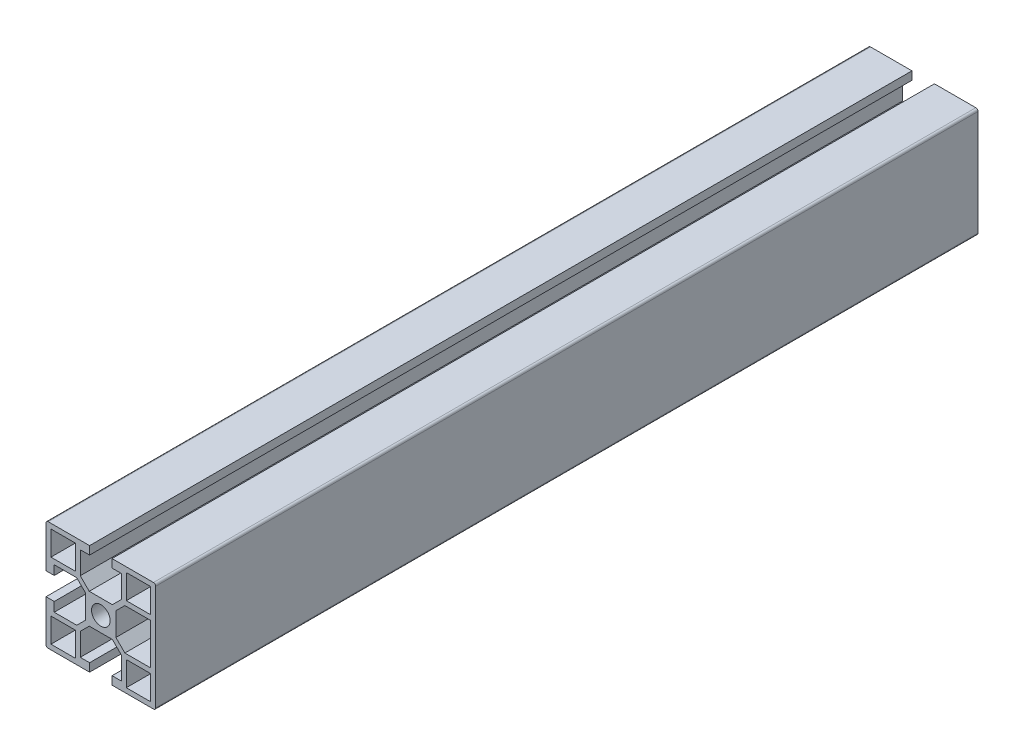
ISO-10303-21;
HEADER;
FILE_DESCRIPTION(('STEP AP214'),'2;1');
FILE_NAME('part.step','',(''),(''),'','','');
FILE_SCHEMA(('AUTOMOTIVE_DESIGN { 1 0 10303 214 1 1 1 1 }'));
ENDSEC;
DATA;
#1=APPLICATION_CONTEXT('core data for automotive mechanical design processes');
#2=APPLICATION_PROTOCOL_DEFINITION('international standard','automotive_design',2000,#1);
#3=PRODUCT_CONTEXT('',#1,'mechanical');
#4=PRODUCT('Part','Part','',(#3));
#5=PRODUCT_RELATED_PRODUCT_CATEGORY('part','',(#4));
#6=PRODUCT_DEFINITION_FORMATION('','',#4);
#7=PRODUCT_DEFINITION_CONTEXT('part definition',#1,'design');
#8=PRODUCT_DEFINITION('design','',#6,#7);
#9=PRODUCT_DEFINITION_SHAPE('','',#8);
#10=(LENGTH_UNIT() NAMED_UNIT(*) SI_UNIT(.MILLI.,.METRE.));
#11=(NAMED_UNIT(*) PLANE_ANGLE_UNIT() SI_UNIT($,.RADIAN.));
#12=(NAMED_UNIT(*) SI_UNIT($,.STERADIAN.) SOLID_ANGLE_UNIT());
#13=UNCERTAINTY_MEASURE_WITH_UNIT(LENGTH_MEASURE(1.E-05),#10,'distance_accuracy_value','');
#14=(GEOMETRIC_REPRESENTATION_CONTEXT(3) GLOBAL_UNCERTAINTY_ASSIGNED_CONTEXT((#13)) GLOBAL_UNIT_ASSIGNED_CONTEXT((#10,
#11,#12)) REPRESENTATION_CONTEXT('',''));
#15=CARTESIAN_POINT('',(0.,0.,0.));
#16=DIRECTION('',(0.,0.,1.));
#17=DIRECTION('',(1.,0.,0.));
#18=AXIS2_PLACEMENT_3D('',#15,#16,#17);
#19=CARTESIAN_POINT('',(7975.74223060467,2649.29356406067,300.));
#20=DIRECTION('',(0.,0.,1.));
#21=DIRECTION('',(1.,0.,0.));
#22=AXIS2_PLACEMENT_3D('',#19,#20,#21);
#23=PLANE('',#22);
#24=CARTESIAN_POINT('',(7975.74223060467,2649.29356406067,300.));
#25=DIRECTION('',(0.,0.,1.));
#26=DIRECTION('',(1.,0.,0.));
#27=AXIS2_PLACEMENT_3D('',#24,#25,#26);
#28=CIRCLE('',#27,0.8000000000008);
#29=CARTESIAN_POINT('',(7976.54223060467,2649.29356406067,300.));
#30=VERTEX_POINT('',#29);
#31=CARTESIAN_POINT('',(7975.74223060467,2650.09356406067,300.));
#32=VERTEX_POINT('',#31);
#33=EDGE_CURVE('E590',#30,#32,#28,.T.);
#34=ORIENTED_EDGE('',*,*,#33,.T.);
#35=DIRECTION('',(-1.,0.,0.));
#36=VECTOR('',#35,1.);
#37=CARTESIAN_POINT('',(7975.74223060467,2650.09356406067,300.));
#38=LINE('',#37,#36);
#39=CARTESIAN_POINT('',(7960.64223060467,2650.09356406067,300.));
#40=VERTEX_POINT('',#39);
#41=EDGE_CURVE('E593',#32,#40,#38,.T.);
#42=ORIENTED_EDGE('',*,*,#41,.T.);
#43=DIRECTION('',(0.,-1.,0.));
#44=VECTOR('',#43,1.);
#45=CARTESIAN_POINT('',(7960.64223060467,2647.09356406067,300.));
#46=LINE('',#45,#44);
#47=CARTESIAN_POINT('',(7960.64223060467,2647.09356406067,300.));
#48=VERTEX_POINT('',#47);
#49=EDGE_CURVE('E596',#40,#48,#46,.T.);
#50=ORIENTED_EDGE('',*,*,#49,.T.);
#51=DIRECTION('',(1.,0.,0.));
#52=VECTOR('',#51,1.);
#53=CARTESIAN_POINT('',(7964.04223060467,2647.09356406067,300.));
#54=LINE('',#53,#52);
#55=CARTESIAN_POINT('',(7964.04223060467,2647.09356406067,300.));
#56=VERTEX_POINT('',#55);
#57=EDGE_CURVE('E598',#48,#56,#54,.T.);
#58=ORIENTED_EDGE('',*,*,#57,.T.);
#59=DIRECTION('',(0.,-1.,0.));
#60=VECTOR('',#59,1.);
#61=CARTESIAN_POINT('',(7964.04223060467,2647.09356406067,300.));
#62=LINE('',#61,#60);
#63=CARTESIAN_POINT('',(7964.04223060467,2638.8663562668,300.));
#64=VERTEX_POINT('',#63);
#65=EDGE_CURVE('E600',#56,#64,#62,.T.);
#66=ORIENTED_EDGE('',*,*,#65,.T.);
#67=DIRECTION('',(-0.707106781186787,-0.707106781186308,0.));
#68=VECTOR('',#67,1.);
#69=CARTESIAN_POINT('',(7960.76943839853,2635.59356406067,300.));
#70=LINE('',#69,#68);
#71=CARTESIAN_POINT('',(7960.76943839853,2635.59356406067,300.));
#72=VERTEX_POINT('',#71);
#73=EDGE_CURVE('E602',#64,#72,#70,.T.);
#74=ORIENTED_EDGE('',*,*,#73,.T.);
#75=DIRECTION('',(-1.,0.,0.));
#76=VECTOR('',#75,1.);
#77=CARTESIAN_POINT('',(7960.76943839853,2635.59356406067,300.));
#78=LINE('',#77,#76);
#79=CARTESIAN_POINT('',(7952.31502281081,2635.59356406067,300.));
#80=VERTEX_POINT('',#79);
#81=EDGE_CURVE('E604',#72,#80,#78,.T.);
#82=ORIENTED_EDGE('',*,*,#81,.T.);
#83=DIRECTION('',(-0.7071067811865,0.707106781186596,0.));
#84=VECTOR('',#83,1.);
#85=CARTESIAN_POINT('',(7952.31502281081,2635.59356406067,300.));
#86=LINE('',#85,#84);
#87=CARTESIAN_POINT('',(7949.04223060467,2638.8663562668,300.));
#88=VERTEX_POINT('',#87);
#89=EDGE_CURVE('E606',#80,#88,#86,.T.);
#90=ORIENTED_EDGE('',*,*,#89,.T.);
#91=DIRECTION('',(0.,1.,0.));
#92=VECTOR('',#91,1.);
#93=CARTESIAN_POINT('',(7949.04223060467,2647.09356406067,300.));
#94=LINE('',#93,#92);
#95=CARTESIAN_POINT('',(7949.04223060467,2647.09356406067,300.));
#96=VERTEX_POINT('',#95);
#97=EDGE_CURVE('E608',#88,#96,#94,.T.);
#98=ORIENTED_EDGE('',*,*,#97,.T.);
#99=DIRECTION('',(1.,0.,0.));
#100=VECTOR('',#99,1.);
#101=CARTESIAN_POINT('',(7949.04223060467,2647.09356406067,300.));
#102=LINE('',#101,#100);
#103=CARTESIAN_POINT('',(7952.44223060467,2647.09356406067,300.));
#104=VERTEX_POINT('',#103);
#105=EDGE_CURVE('E610',#96,#104,#102,.T.);
#106=ORIENTED_EDGE('',*,*,#105,.T.);
#107=DIRECTION('',(0.,1.,0.));
#108=VECTOR('',#107,1.);
#109=CARTESIAN_POINT('',(7952.44223060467,2647.09356406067,300.));
#110=LINE('',#109,#108);
#111=CARTESIAN_POINT('',(7952.44223060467,2650.09356406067,300.));
#112=VERTEX_POINT('',#111);
#113=EDGE_CURVE('E612',#104,#112,#110,.T.);
#114=ORIENTED_EDGE('',*,*,#113,.T.);
#115=DIRECTION('',(-1.,0.,0.));
#116=VECTOR('',#115,1.);
#117=CARTESIAN_POINT('',(7937.34223060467,2650.09356406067,300.));
#118=LINE('',#117,#116);
#119=CARTESIAN_POINT('',(7937.34223060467,2650.09356406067,300.));
#120=VERTEX_POINT('',#119);
#121=EDGE_CURVE('E614',#112,#120,#118,.T.);
#122=ORIENTED_EDGE('',*,*,#121,.T.);
#123=CARTESIAN_POINT('',(7937.34223060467,2649.29356406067,300.));
#124=DIRECTION('',(0.,0.,1.));
#125=DIRECTION('',(1.,0.,0.));
#126=AXIS2_PLACEMENT_3D('',#123,#124,#125);
#127=CIRCLE('',#126,0.799999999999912);
#128=CARTESIAN_POINT('',(7936.54223060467,2649.29356406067,300.));
#129=VERTEX_POINT('',#128);
#130=EDGE_CURVE('E616',#120,#129,#127,.T.);
#131=ORIENTED_EDGE('',*,*,#130,.T.);
#132=DIRECTION('',(0.,-1.,0.));
#133=VECTOR('',#132,1.);
#134=CARTESIAN_POINT('',(7936.54223060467,2634.19356406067,300.));
#135=LINE('',#134,#133);
#136=CARTESIAN_POINT('',(7936.54223060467,2634.19356406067,300.));
#137=VERTEX_POINT('',#136);
#138=EDGE_CURVE('E618',#129,#137,#135,.T.);
#139=ORIENTED_EDGE('',*,*,#138,.T.);
#140=DIRECTION('',(1.,0.,0.));
#141=VECTOR('',#140,1.);
#142=CARTESIAN_POINT('',(7936.54223060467,2634.19356406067,300.));
#143=LINE('',#142,#141);
#144=CARTESIAN_POINT('',(7939.54223060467,2634.19356406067,300.));
#145=VERTEX_POINT('',#144);
#146=EDGE_CURVE('E620',#137,#145,#143,.T.);
#147=ORIENTED_EDGE('',*,*,#146,.T.);
#148=DIRECTION('',(0.,1.,0.));
#149=VECTOR('',#148,1.);
#150=CARTESIAN_POINT('',(7939.54223060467,2634.19356406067,300.));
#151=LINE('',#150,#149);
#152=CARTESIAN_POINT('',(7939.54223060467,2637.59356406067,300.));
#153=VERTEX_POINT('',#152);
#154=EDGE_CURVE('E622',#145,#153,#151,.T.);
#155=ORIENTED_EDGE('',*,*,#154,.T.);
#156=DIRECTION('',(1.,0.,0.));
#157=VECTOR('',#156,1.);
#158=CARTESIAN_POINT('',(7939.54223060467,2637.59356406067,300.));
#159=LINE('',#158,#157);
#160=CARTESIAN_POINT('',(7947.76943839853,2637.59356406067,300.));
#161=VERTEX_POINT('',#160);
#162=EDGE_CURVE('E624',#153,#161,#159,.T.);
#163=ORIENTED_EDGE('',*,*,#162,.T.);
#164=DIRECTION('',(0.707106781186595,-0.7071067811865,0.));
#165=VECTOR('',#164,1.);
#166=CARTESIAN_POINT('',(7951.04223060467,2634.32077185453,300.));
#167=LINE('',#166,#165);
#168=CARTESIAN_POINT('',(7951.04223060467,2634.32077185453,300.));
#169=VERTEX_POINT('',#168);
#170=EDGE_CURVE('E626',#161,#169,#167,.T.);
#171=ORIENTED_EDGE('',*,*,#170,.T.);
#172=DIRECTION('',(0.,-1.,0.));
#173=VECTOR('',#172,1.);
#174=CARTESIAN_POINT('',(7951.04223060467,2625.8663562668,300.));
#175=LINE('',#174,#173);
#176=CARTESIAN_POINT('',(7951.04223060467,2625.8663562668,300.));
#177=VERTEX_POINT('',#176);
#178=EDGE_CURVE('E628',#169,#177,#175,.T.);
#179=ORIENTED_EDGE('',*,*,#178,.T.);
#180=DIRECTION('',(-0.707106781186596,-0.7071067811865,0.));
#181=VECTOR('',#180,1.);
#182=CARTESIAN_POINT('',(7951.04223060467,2625.8663562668,300.));
#183=LINE('',#182,#181);
#184=CARTESIAN_POINT('',(7947.76943839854,2622.59356406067,300.));
#185=VERTEX_POINT('',#184);
#186=EDGE_CURVE('E630',#177,#185,#183,.T.);
#187=ORIENTED_EDGE('',*,*,#186,.T.);
#188=DIRECTION('',(-1.,0.,0.));
#189=VECTOR('',#188,1.);
#190=CARTESIAN_POINT('',(7939.54223060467,2622.59356406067,300.));
#191=LINE('',#190,#189);
#192=CARTESIAN_POINT('',(7939.54223060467,2622.59356406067,300.));
#193=VERTEX_POINT('',#192);
#194=EDGE_CURVE('E632',#185,#193,#191,.T.);
#195=ORIENTED_EDGE('',*,*,#194,.T.);
#196=DIRECTION('',(0.,1.,0.));
#197=VECTOR('',#196,1.);
#198=CARTESIAN_POINT('',(7939.54223060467,2625.99356406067,300.));
#199=LINE('',#198,#197);
#200=CARTESIAN_POINT('',(7939.54223060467,2625.99356406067,300.));
#201=VERTEX_POINT('',#200);
#202=EDGE_CURVE('E634',#193,#201,#199,.T.);
#203=ORIENTED_EDGE('',*,*,#202,.T.);
#204=DIRECTION('',(-1.,0.,0.));
#205=VECTOR('',#204,1.);
#206=CARTESIAN_POINT('',(7936.54223060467,2625.99356406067,300.));
#207=LINE('',#206,#205);
#208=CARTESIAN_POINT('',(7936.54223060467,2625.99356406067,300.));
#209=VERTEX_POINT('',#208);
#210=EDGE_CURVE('E636',#201,#209,#207,.T.);
#211=ORIENTED_EDGE('',*,*,#210,.T.);
#212=DIRECTION('',(0.,-1.,0.));
#213=VECTOR('',#212,1.);
#214=CARTESIAN_POINT('',(7936.54223060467,2625.99356406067,300.));
#215=LINE('',#214,#213);
#216=CARTESIAN_POINT('',(7936.54223060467,2610.89356406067,300.));
#217=VERTEX_POINT('',#216);
#218=EDGE_CURVE('E638',#209,#217,#215,.T.);
#219=ORIENTED_EDGE('',*,*,#218,.T.);
#220=CARTESIAN_POINT('',(7937.34223060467,2610.89356406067,300.));
#221=DIRECTION('',(0.,0.,1.));
#222=DIRECTION('',(1.,0.,0.));
#223=AXIS2_PLACEMENT_3D('',#220,#221,#222);
#224=CIRCLE('',#223,0.800000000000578);
#225=CARTESIAN_POINT('',(7937.34223060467,2610.09356406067,300.));
#226=VERTEX_POINT('',#225);
#227=EDGE_CURVE('E640',#217,#226,#224,.T.);
#228=ORIENTED_EDGE('',*,*,#227,.T.);
#229=DIRECTION('',(1.,0.,0.));
#230=VECTOR('',#229,1.);
#231=CARTESIAN_POINT('',(7937.34223060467,2610.09356406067,300.));
#232=LINE('',#231,#230);
#233=CARTESIAN_POINT('',(7952.44223060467,2610.09356406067,300.));
#234=VERTEX_POINT('',#233);
#235=EDGE_CURVE('E642',#226,#234,#232,.T.);
#236=ORIENTED_EDGE('',*,*,#235,.T.);
#237=DIRECTION('',(0.,1.,0.));
#238=VECTOR('',#237,1.);
#239=CARTESIAN_POINT('',(7952.44223060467,2613.09356406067,300.));
#240=LINE('',#239,#238);
#241=CARTESIAN_POINT('',(7952.44223060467,2613.09356406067,300.));
#242=VERTEX_POINT('',#241);
#243=EDGE_CURVE('E644',#234,#242,#240,.T.);
#244=ORIENTED_EDGE('',*,*,#243,.T.);
#245=DIRECTION('',(-1.,0.,0.));
#246=VECTOR('',#245,1.);
#247=CARTESIAN_POINT('',(7949.04223060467,2613.09356406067,300.));
#248=LINE('',#247,#246);
#249=CARTESIAN_POINT('',(7949.04223060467,2613.09356406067,300.));
#250=VERTEX_POINT('',#249);
#251=EDGE_CURVE('E646',#242,#250,#248,.T.);
#252=ORIENTED_EDGE('',*,*,#251,.T.);
#253=DIRECTION('',(0.,1.,0.));
#254=VECTOR('',#253,1.);
#255=CARTESIAN_POINT('',(7949.04223060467,2613.09356406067,300.));
#256=LINE('',#255,#254);
#257=CARTESIAN_POINT('',(7949.04223060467,2621.32077185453,300.));
#258=VERTEX_POINT('',#257);
#259=EDGE_CURVE('E648',#250,#258,#256,.T.);
#260=ORIENTED_EDGE('',*,*,#259,.T.);
#261=DIRECTION('',(0.707106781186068,0.707106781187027,0.));
#262=VECTOR('',#261,1.);
#263=CARTESIAN_POINT('',(7952.31502281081,2624.59356406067,300.));
#264=LINE('',#263,#262);
#265=CARTESIAN_POINT('',(7952.31502281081,2624.59356406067,300.));
#266=VERTEX_POINT('',#265);
#267=EDGE_CURVE('E650',#258,#266,#264,.T.);
#268=ORIENTED_EDGE('',*,*,#267,.T.);
#269=DIRECTION('',(1.,0.,0.));
#270=VECTOR('',#269,1.);
#271=CARTESIAN_POINT('',(7960.76943839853,2624.59356406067,300.));
#272=LINE('',#271,#270);
#273=CARTESIAN_POINT('',(7960.76943839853,2624.59356406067,300.));
#274=VERTEX_POINT('',#273);
#275=EDGE_CURVE('E652',#266,#274,#272,.T.);
#276=ORIENTED_EDGE('',*,*,#275,.T.);
#277=DIRECTION('',(0.707106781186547,-0.707106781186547,0.));
#278=VECTOR('',#277,1.);
#279=CARTESIAN_POINT('',(7960.76943839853,2624.59356406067,300.));
#280=LINE('',#279,#278);
#281=CARTESIAN_POINT('',(7964.04223060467,2621.32077185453,300.));
#282=VERTEX_POINT('',#281);
#283=EDGE_CURVE('E654',#274,#282,#280,.T.);
#284=ORIENTED_EDGE('',*,*,#283,.T.);
#285=DIRECTION('',(0.,-1.,0.));
#286=VECTOR('',#285,1.);
#287=CARTESIAN_POINT('',(7964.04223060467,2613.09356406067,300.));
#288=LINE('',#287,#286);
#289=CARTESIAN_POINT('',(7964.04223060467,2613.09356406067,300.));
#290=VERTEX_POINT('',#289);
#291=EDGE_CURVE('E656',#282,#290,#288,.T.);
#292=ORIENTED_EDGE('',*,*,#291,.T.);
#293=DIRECTION('',(-1.,0.,0.));
#294=VECTOR('',#293,1.);
#295=CARTESIAN_POINT('',(7964.04223060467,2613.09356406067,300.));
#296=LINE('',#295,#294);
#297=CARTESIAN_POINT('',(7960.64223060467,2613.09356406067,300.));
#298=VERTEX_POINT('',#297);
#299=EDGE_CURVE('E658',#290,#298,#296,.T.);
#300=ORIENTED_EDGE('',*,*,#299,.T.);
#301=DIRECTION('',(0.,-1.,0.));
#302=VECTOR('',#301,1.);
#303=CARTESIAN_POINT('',(7960.64223060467,2613.09356406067,300.));
#304=LINE('',#303,#302);
#305=CARTESIAN_POINT('',(7960.64223060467,2610.09356406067,300.));
#306=VERTEX_POINT('',#305);
#307=EDGE_CURVE('E660',#298,#306,#304,.T.);
#308=ORIENTED_EDGE('',*,*,#307,.T.);
#309=DIRECTION('',(1.,-1.17639525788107E-13,0.));
#310=VECTOR('',#309,1.);
#311=CARTESIAN_POINT('',(7975.74223060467,2610.09356406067,300.));
#312=LINE('',#311,#310);
#313=CARTESIAN_POINT('',(7975.74223060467,2610.09356406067,300.));
#314=VERTEX_POINT('',#313);
#315=EDGE_CURVE('E662',#306,#314,#312,.T.);
#316=ORIENTED_EDGE('',*,*,#315,.T.);
#317=CARTESIAN_POINT('',(7975.74223060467,2610.89356406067,300.));
#318=DIRECTION('',(0.,0.,1.));
#319=DIRECTION('',(1.,0.,0.));
#320=AXIS2_PLACEMENT_3D('',#317,#318,#319);
#321=CIRCLE('',#320,0.8000000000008);
#322=CARTESIAN_POINT('',(7976.54223060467,2610.89356406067,300.));
#323=VERTEX_POINT('',#322);
#324=EDGE_CURVE('E664',#314,#323,#321,.T.);
#325=ORIENTED_EDGE('',*,*,#324,.T.);
#326=DIRECTION('',(0.,1.,0.));
#327=VECTOR('',#326,1.);
#328=CARTESIAN_POINT('',(7976.54223060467,2610.89356406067,300.));
#329=LINE('',#328,#327);
#330=EDGE_CURVE('E666',#323,#30,#329,.T.);
#331=ORIENTED_EDGE('',*,*,#330,.T.);
#332=EDGE_LOOP('',(#34,#42,#50,#58,#66,#74,#82,#90,#98,#106,#114,#122,#131,#139,#147,#155,#163,
#171,#179,#187,#195,#203,#211,#219,#228,#236,#244,#252,#260,#268,#276,#284,#292,#300,#308,#316,
#325,#331));
#333=FACE_BOUND('',#332,.T.);
#334=CARTESIAN_POINT('',(7956.54223060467,2630.09356406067,300.));
#335=DIRECTION('',(0.,0.,1.));
#336=DIRECTION('',(1.,0.,0.));
#337=AXIS2_PLACEMENT_3D('',#334,#335,#336);
#338=CIRCLE('',#337,3.40000000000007);
#339=CARTESIAN_POINT('',(7959.94223060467,2630.09356406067,300.));
#340=VERTEX_POINT('',#339);
#341=EDGE_CURVE('E584',#340,#340,#338,.T.);
#342=ORIENTED_EDGE('',*,*,#341,.F.);
#343=EDGE_LOOP('',(#342));
#344=FACE_BOUND('',#343,.T.);
#345=DIRECTION('',(0.,1.,0.));
#346=VECTOR('',#345,1.);
#347=CARTESIAN_POINT('',(7974.74223060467,2622.59356406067,300.));
#348=LINE('',#347,#346);
#349=CARTESIAN_POINT('',(7974.74223060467,2622.59356406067,300.));
#350=VERTEX_POINT('',#349);
#351=CARTESIAN_POINT('',(7974.74223060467,2637.59356406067,300.));
#352=VERTEX_POINT('',#351);
#353=EDGE_CURVE('E541',#350,#352,#348,.T.);
#354=ORIENTED_EDGE('',*,*,#353,.F.);
#355=DIRECTION('',(1.,0.,0.));
#356=VECTOR('',#355,1.);
#357=CARTESIAN_POINT('',(7965.31502281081,2622.59356406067,300.));
#358=LINE('',#357,#356);
#359=CARTESIAN_POINT('',(7965.31502281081,2622.59356406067,300.));
#360=VERTEX_POINT('',#359);
#361=EDGE_CURVE('E539',#360,#350,#358,.T.);
#362=ORIENTED_EDGE('',*,*,#361,.F.);
#363=DIRECTION('',(0.7071067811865,-0.707106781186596,0.));
#364=VECTOR('',#363,1.);
#365=CARTESIAN_POINT('',(7962.04223060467,2625.8663562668,300.));
#366=LINE('',#365,#364);
#367=CARTESIAN_POINT('',(7962.04223060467,2625.8663562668,300.));
#368=VERTEX_POINT('',#367);
#369=EDGE_CURVE('E551',#368,#360,#366,.T.);
#370=ORIENTED_EDGE('',*,*,#369,.F.);
#371=DIRECTION('',(0.,-1.,0.));
#372=VECTOR('',#371,1.);
#373=CARTESIAN_POINT('',(7962.04223060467,2634.32077185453,300.));
#374=LINE('',#373,#372);
#375=CARTESIAN_POINT('',(7962.04223060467,2634.32077185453,300.));
#376=VERTEX_POINT('',#375);
#377=EDGE_CURVE('E548',#376,#368,#374,.T.);
#378=ORIENTED_EDGE('',*,*,#377,.F.);
#379=DIRECTION('',(-0.707106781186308,-0.707106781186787,0.));
#380=VECTOR('',#379,1.);
#381=CARTESIAN_POINT('',(7965.31502281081,2637.59356406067,300.));
#382=LINE('',#381,#380);
#383=CARTESIAN_POINT('',(7965.31502281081,2637.59356406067,300.));
#384=VERTEX_POINT('',#383);
#385=EDGE_CURVE('E546',#384,#376,#382,.T.);
#386=ORIENTED_EDGE('',*,*,#385,.F.);
#387=DIRECTION('',(-1.,1.88428735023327E-13,0.));
#388=VECTOR('',#387,1.);
#389=CARTESIAN_POINT('',(7974.74223060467,2637.59356406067,300.));
#390=LINE('',#389,#388);
#391=EDGE_CURVE('E544',#352,#384,#390,.T.);
#392=ORIENTED_EDGE('',*,*,#391,.F.);
#393=EDGE_LOOP('',(#354,#362,#370,#378,#386,#392));
#394=FACE_BOUND('',#393,.T.);
#395=DIRECTION('',(-1.,0.,0.));
#396=VECTOR('',#395,1.);
#397=CARTESIAN_POINT('',(7974.74223060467,2648.29356406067,300.));
#398=LINE('',#397,#396);
#399=CARTESIAN_POINT('',(7974.74223060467,2648.29356406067,300.));
#400=VERTEX_POINT('',#399);
#401=CARTESIAN_POINT('',(7965.84223060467,2648.29356406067,300.));
#402=VERTEX_POINT('',#401);
#403=EDGE_CURVE('E510',#400,#402,#398,.T.);
#404=ORIENTED_EDGE('',*,*,#403,.F.);
#405=DIRECTION('',(0.,1.,0.));
#406=VECTOR('',#405,1.);
#407=CARTESIAN_POINT('',(7974.74223060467,2639.39356406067,300.));
#408=LINE('',#407,#406);
#409=CARTESIAN_POINT('',(7974.74223060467,2639.39356406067,300.));
#410=VERTEX_POINT('',#409);
#411=EDGE_CURVE('E508',#410,#400,#408,.T.);
#412=ORIENTED_EDGE('',*,*,#411,.F.);
#413=DIRECTION('',(1.,0.,0.));
#414=VECTOR('',#413,1.);
#415=CARTESIAN_POINT('',(7965.84223060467,2639.39356406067,300.));
#416=LINE('',#415,#414);
#417=CARTESIAN_POINT('',(7965.84223060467,2639.39356406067,300.));
#418=VERTEX_POINT('',#417);
#419=EDGE_CURVE('E516',#418,#410,#416,.T.);
#420=ORIENTED_EDGE('',*,*,#419,.F.);
#421=DIRECTION('',(0.,-1.,0.));
#422=VECTOR('',#421,1.);
#423=CARTESIAN_POINT('',(7965.84223060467,2648.29356406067,300.));
#424=LINE('',#423,#422);
#425=EDGE_CURVE('E513',#402,#418,#424,.T.);
#426=ORIENTED_EDGE('',*,*,#425,.F.);
#427=EDGE_LOOP('',(#404,#412,#420,#426));
#428=FACE_BOUND('',#427,.T.);
#429=DIRECTION('',(1.,0.,0.));
#430=VECTOR('',#429,1.);
#431=CARTESIAN_POINT('',(7965.84223060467,2611.89356406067,300.));
#432=LINE('',#431,#430);
#433=CARTESIAN_POINT('',(7965.84223060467,2611.89356406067,300.));
#434=VERTEX_POINT('',#433);
#435=CARTESIAN_POINT('',(7974.74223060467,2611.89356406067,300.));
#436=VERTEX_POINT('',#435);
#437=EDGE_CURVE('E479',#434,#436,#432,.T.);
#438=ORIENTED_EDGE('',*,*,#437,.F.);
#439=DIRECTION('',(0.,-1.,0.));
#440=VECTOR('',#439,1.);
#441=CARTESIAN_POINT('',(7965.84223060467,2620.79356406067,300.));
#442=LINE('',#441,#440);
#443=CARTESIAN_POINT('',(7965.84223060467,2620.79356406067,300.));
#444=VERTEX_POINT('',#443);
#445=EDGE_CURVE('E477',#444,#434,#442,.T.);
#446=ORIENTED_EDGE('',*,*,#445,.F.);
#447=DIRECTION('',(-1.,0.,0.));
#448=VECTOR('',#447,1.);
#449=CARTESIAN_POINT('',(7974.74223060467,2620.79356406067,300.));
#450=LINE('',#449,#448);
#451=CARTESIAN_POINT('',(7974.74223060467,2620.79356406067,300.));
#452=VERTEX_POINT('',#451);
#453=EDGE_CURVE('E485',#452,#444,#450,.T.);
#454=ORIENTED_EDGE('',*,*,#453,.F.);
#455=DIRECTION('',(0.,1.,0.));
#456=VECTOR('',#455,1.);
#457=CARTESIAN_POINT('',(7974.74223060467,2611.89356406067,300.));
#458=LINE('',#457,#456);
#459=EDGE_CURVE('E482',#436,#452,#458,.T.);
#460=ORIENTED_EDGE('',*,*,#459,.F.);
#461=EDGE_LOOP('',(#438,#446,#454,#460));
#462=FACE_BOUND('',#461,.T.);
#463=DIRECTION('',(1.,0.,0.));
#464=VECTOR('',#463,1.);
#465=CARTESIAN_POINT('',(7938.34223060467,2611.89356406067,300.));
#466=LINE('',#465,#464);
#467=CARTESIAN_POINT('',(7938.34223060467,2611.89356406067,300.));
#468=VERTEX_POINT('',#467);
#469=CARTESIAN_POINT('',(7947.24223060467,2611.89356406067,300.));
#470=VERTEX_POINT('',#469);
#471=EDGE_CURVE('E448',#468,#470,#466,.T.);
#472=ORIENTED_EDGE('',*,*,#471,.F.);
#473=DIRECTION('',(0.,-1.,0.));
#474=VECTOR('',#473,1.);
#475=CARTESIAN_POINT('',(7938.34223060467,2620.79356406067,300.));
#476=LINE('',#475,#474);
#477=CARTESIAN_POINT('',(7938.34223060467,2620.79356406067,300.));
#478=VERTEX_POINT('',#477);
#479=EDGE_CURVE('E446',#478,#468,#476,.T.);
#480=ORIENTED_EDGE('',*,*,#479,.F.);
#481=DIRECTION('',(-1.,0.,0.));
#482=VECTOR('',#481,1.);
#483=CARTESIAN_POINT('',(7947.24223060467,2620.79356406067,300.));
#484=LINE('',#483,#482);
#485=CARTESIAN_POINT('',(7947.24223060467,2620.79356406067,300.));
#486=VERTEX_POINT('',#485);
#487=EDGE_CURVE('E454',#486,#478,#484,.T.);
#488=ORIENTED_EDGE('',*,*,#487,.F.);
#489=DIRECTION('',(0.,1.,0.));
#490=VECTOR('',#489,1.);
#491=CARTESIAN_POINT('',(7947.24223060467,2611.89356406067,300.));
#492=LINE('',#491,#490);
#493=EDGE_CURVE('E451',#470,#486,#492,.T.);
#494=ORIENTED_EDGE('',*,*,#493,.F.);
#495=EDGE_LOOP('',(#472,#480,#488,#494));
#496=FACE_BOUND('',#495,.T.);
#497=DIRECTION('',(-1.,0.,0.));
#498=VECTOR('',#497,1.);
#499=CARTESIAN_POINT('',(7947.24223060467,2648.29356406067,300.));
#500=LINE('',#499,#498);
#501=CARTESIAN_POINT('',(7947.24223060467,2648.29356406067,300.));
#502=VERTEX_POINT('',#501);
#503=CARTESIAN_POINT('',(7938.34223060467,2648.29356406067,300.));
#504=VERTEX_POINT('',#503);
#505=EDGE_CURVE('E418',#502,#504,#500,.T.);
#506=ORIENTED_EDGE('',*,*,#505,.F.);
#507=DIRECTION('',(0.,1.,0.));
#508=VECTOR('',#507,1.);
#509=CARTESIAN_POINT('',(7947.24223060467,2639.39356406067,300.));
#510=LINE('',#509,#508);
#511=CARTESIAN_POINT('',(7947.24223060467,2639.39356406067,300.));
#512=VERTEX_POINT('',#511);
#513=EDGE_CURVE('E410',#512,#502,#510,.T.);
#514=ORIENTED_EDGE('',*,*,#513,.F.);
#515=DIRECTION('',(1.,0.,0.));
#516=VECTOR('',#515,1.);
#517=CARTESIAN_POINT('',(7938.34223060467,2639.39356406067,300.));
#518=LINE('',#517,#516);
#519=CARTESIAN_POINT('',(7938.34223060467,2639.39356406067,300.));
#520=VERTEX_POINT('',#519);
#521=EDGE_CURVE('E432',#520,#512,#518,.T.);
#522=ORIENTED_EDGE('',*,*,#521,.F.);
#523=DIRECTION('',(0.,-1.,0.));
#524=VECTOR('',#523,1.);
#525=CARTESIAN_POINT('',(7938.34223060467,2648.29356406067,300.));
#526=LINE('',#525,#524);
#527=EDGE_CURVE('E430',#504,#520,#526,.T.);
#528=ORIENTED_EDGE('',*,*,#527,.F.);
#529=EDGE_LOOP('',(#506,#514,#522,#528));
#530=FACE_BOUND('',#529,.T.);
#531=ADVANCED_FACE('F33',(#333,#344,#394,#428,#462,#496,#530),#23,.T.);
#532=CARTESIAN_POINT('',(7975.74223060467,2649.29356406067,0.));
#533=DIRECTION('',(0.,0.,1.));
#534=DIRECTION('',(1.,0.,0.));
#535=AXIS2_PLACEMENT_3D('',#532,#533,#534);
#536=PLANE('',#535);
#537=DIRECTION('',(0.,-1.,0.));
#538=VECTOR('',#537,1.);
#539=CARTESIAN_POINT('',(7938.34223060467,2620.79356406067,0.));
#540=LINE('',#539,#538);
#541=CARTESIAN_POINT('',(7938.34223060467,2620.79356406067,0.));
#542=VERTEX_POINT('',#541);
#543=CARTESIAN_POINT('',(7938.34223060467,2611.89356406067,0.));
#544=VERTEX_POINT('',#543);
#545=EDGE_CURVE('E426',#542,#544,#540,.T.);
#546=ORIENTED_EDGE('',*,*,#545,.T.);
#547=DIRECTION('',(1.,0.,0.));
#548=VECTOR('',#547,1.);
#549=CARTESIAN_POINT('',(7938.34223060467,2611.89356406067,0.));
#550=LINE('',#549,#548);
#551=CARTESIAN_POINT('',(7947.24223060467,2611.89356406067,0.));
#552=VERTEX_POINT('',#551);
#553=EDGE_CURVE('E459',#544,#552,#550,.T.);
#554=ORIENTED_EDGE('',*,*,#553,.T.);
#555=DIRECTION('',(0.,1.,0.));
#556=VECTOR('',#555,1.);
#557=CARTESIAN_POINT('',(7947.24223060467,2611.89356406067,0.));
#558=LINE('',#557,#556);
#559=CARTESIAN_POINT('',(7947.24223060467,2620.79356406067,0.));
#560=VERTEX_POINT('',#559);
#561=EDGE_CURVE('E462',#552,#560,#558,.T.);
#562=ORIENTED_EDGE('',*,*,#561,.T.);
#563=DIRECTION('',(-1.,0.,0.));
#564=VECTOR('',#563,1.);
#565=CARTESIAN_POINT('',(7947.24223060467,2620.79356406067,0.));
#566=LINE('',#565,#564);
#567=EDGE_CURVE('E449',#560,#542,#566,.T.);
#568=ORIENTED_EDGE('',*,*,#567,.T.);
#569=EDGE_LOOP('',(#546,#554,#562,#568));
#570=FACE_BOUND('',#569,.T.);
#571=DIRECTION('',(0.,1.,0.));
#572=VECTOR('',#571,1.);
#573=CARTESIAN_POINT('',(7974.74223060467,2639.39356406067,0.));
#574=LINE('',#573,#572);
#575=CARTESIAN_POINT('',(7974.74223060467,2639.39356406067,0.));
#576=VERTEX_POINT('',#575);
#577=CARTESIAN_POINT('',(7974.74223060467,2648.29356406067,0.));
#578=VERTEX_POINT('',#577);
#579=EDGE_CURVE('E507',#576,#578,#574,.T.);
#580=ORIENTED_EDGE('',*,*,#579,.T.);
#581=DIRECTION('',(-1.,0.,0.));
#582=VECTOR('',#581,1.);
#583=CARTESIAN_POINT('',(7974.74223060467,2648.29356406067,0.));
#584=LINE('',#583,#582);
#585=CARTESIAN_POINT('',(7965.84223060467,2648.29356406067,0.));
#586=VERTEX_POINT('',#585);
#587=EDGE_CURVE('E521',#578,#586,#584,.T.);
#588=ORIENTED_EDGE('',*,*,#587,.T.);
#589=DIRECTION('',(0.,-1.,0.));
#590=VECTOR('',#589,1.);
#591=CARTESIAN_POINT('',(7965.84223060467,2648.29356406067,0.));
#592=LINE('',#591,#590);
#593=CARTESIAN_POINT('',(7965.84223060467,2639.39356406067,0.));
#594=VERTEX_POINT('',#593);
#595=EDGE_CURVE('E524',#586,#594,#592,.T.);
#596=ORIENTED_EDGE('',*,*,#595,.T.);
#597=DIRECTION('',(1.,0.,0.));
#598=VECTOR('',#597,1.);
#599=CARTESIAN_POINT('',(7965.84223060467,2639.39356406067,0.));
#600=LINE('',#599,#598);
#601=EDGE_CURVE('E511',#594,#576,#600,.T.);
#602=ORIENTED_EDGE('',*,*,#601,.T.);
#603=EDGE_LOOP('',(#580,#588,#596,#602));
#604=FACE_BOUND('',#603,.T.);
#605=CARTESIAN_POINT('',(7956.54223060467,2630.09356406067,0.));
#606=DIRECTION('',(0.,0.,1.));
#607=DIRECTION('',(1.,0.,0.));
#608=AXIS2_PLACEMENT_3D('',#605,#606,#607);
#609=CIRCLE('',#608,3.40000000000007);
#610=CARTESIAN_POINT('',(7959.94223060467,2630.09356406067,0.));
#611=VERTEX_POINT('',#610);
#612=EDGE_CURVE('E583',#611,#611,#609,.T.);
#613=ORIENTED_EDGE('',*,*,#612,.T.);
#614=EDGE_LOOP('',(#613));
#615=FACE_BOUND('',#614,.T.);
#616=CARTESIAN_POINT('',(7975.74223060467,2649.29356406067,0.));
#617=DIRECTION('',(0.,0.,1.));
#618=DIRECTION('',(1.,0.,0.));
#619=AXIS2_PLACEMENT_3D('',#616,#617,#618);
#620=CIRCLE('',#619,0.8000000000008);
#621=CARTESIAN_POINT('',(7976.54223060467,2649.29356406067,0.));
#622=VERTEX_POINT('',#621);
#623=CARTESIAN_POINT('',(7975.74223060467,2650.09356406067,0.));
#624=VERTEX_POINT('',#623);
#625=EDGE_CURVE('E587',#622,#624,#620,.T.);
#626=ORIENTED_EDGE('',*,*,#625,.F.);
#627=DIRECTION('',(0.,1.,0.));
#628=VECTOR('',#627,1.);
#629=CARTESIAN_POINT('',(7976.54223060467,2610.89356406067,0.));
#630=LINE('',#629,#628);
#631=CARTESIAN_POINT('',(7976.54223060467,2610.89356406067,0.));
#632=VERTEX_POINT('',#631);
#633=EDGE_CURVE('E594',#632,#622,#630,.T.);
#634=ORIENTED_EDGE('',*,*,#633,.F.);
#635=CARTESIAN_POINT('',(7975.74223060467,2610.89356406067,0.));
#636=DIRECTION('',(0.,0.,1.));
#637=DIRECTION('',(1.,0.,0.));
#638=AXIS2_PLACEMENT_3D('',#635,#636,#637);
#639=CIRCLE('',#638,0.8000000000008);
#640=CARTESIAN_POINT('',(7975.74223060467,2610.09356406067,0.));
#641=VERTEX_POINT('',#640);
#642=EDGE_CURVE('E741',#641,#632,#639,.T.);
#643=ORIENTED_EDGE('',*,*,#642,.F.);
#644=DIRECTION('',(1.,-1.17639525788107E-13,0.));
#645=VECTOR('',#644,1.);
#646=CARTESIAN_POINT('',(7975.74223060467,2610.09356406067,0.));
#647=LINE('',#646,#645);
#648=CARTESIAN_POINT('',(7960.64223060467,2610.09356406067,0.));
#649=VERTEX_POINT('',#648);
#650=EDGE_CURVE('E739',#649,#641,#647,.T.);
#651=ORIENTED_EDGE('',*,*,#650,.F.);
#652=DIRECTION('',(0.,-1.,0.));
#653=VECTOR('',#652,1.);
#654=CARTESIAN_POINT('',(7960.64223060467,2613.09356406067,0.));
#655=LINE('',#654,#653);
#656=CARTESIAN_POINT('',(7960.64223060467,2613.09356406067,0.));
#657=VERTEX_POINT('',#656);
#658=EDGE_CURVE('E737',#657,#649,#655,.T.);
#659=ORIENTED_EDGE('',*,*,#658,.F.);
#660=DIRECTION('',(-1.,0.,0.));
#661=VECTOR('',#660,1.);
#662=CARTESIAN_POINT('',(7964.04223060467,2613.09356406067,0.));
#663=LINE('',#662,#661);
#664=CARTESIAN_POINT('',(7964.04223060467,2613.09356406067,0.));
#665=VERTEX_POINT('',#664);
#666=EDGE_CURVE('E735',#665,#657,#663,.T.);
#667=ORIENTED_EDGE('',*,*,#666,.F.);
#668=DIRECTION('',(0.,-1.,0.));
#669=VECTOR('',#668,1.);
#670=CARTESIAN_POINT('',(7964.04223060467,2613.09356406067,0.));
#671=LINE('',#670,#669);
#672=CARTESIAN_POINT('',(7964.04223060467,2621.32077185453,0.));
#673=VERTEX_POINT('',#672);
#674=EDGE_CURVE('E733',#673,#665,#671,.T.);
#675=ORIENTED_EDGE('',*,*,#674,.F.);
#676=DIRECTION('',(0.707106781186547,-0.707106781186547,0.));
#677=VECTOR('',#676,1.);
#678=CARTESIAN_POINT('',(7960.76943839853,2624.59356406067,0.));
#679=LINE('',#678,#677);
#680=CARTESIAN_POINT('',(7960.76943839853,2624.59356406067,0.));
#681=VERTEX_POINT('',#680);
#682=EDGE_CURVE('E731',#681,#673,#679,.T.);
#683=ORIENTED_EDGE('',*,*,#682,.F.);
#684=DIRECTION('',(1.,0.,0.));
#685=VECTOR('',#684,1.);
#686=CARTESIAN_POINT('',(7960.76943839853,2624.59356406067,0.));
#687=LINE('',#686,#685);
#688=CARTESIAN_POINT('',(7952.31502281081,2624.59356406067,0.));
#689=VERTEX_POINT('',#688);
#690=EDGE_CURVE('E729',#689,#681,#687,.T.);
#691=ORIENTED_EDGE('',*,*,#690,.F.);
#692=DIRECTION('',(0.707106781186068,0.707106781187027,0.));
#693=VECTOR('',#692,1.);
#694=CARTESIAN_POINT('',(7952.31502281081,2624.59356406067,0.));
#695=LINE('',#694,#693);
#696=CARTESIAN_POINT('',(7949.04223060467,2621.32077185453,0.));
#697=VERTEX_POINT('',#696);
#698=EDGE_CURVE('E727',#697,#689,#695,.T.);
#699=ORIENTED_EDGE('',*,*,#698,.F.);
#700=DIRECTION('',(0.,1.,0.));
#701=VECTOR('',#700,1.);
#702=CARTESIAN_POINT('',(7949.04223060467,2613.09356406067,0.));
#703=LINE('',#702,#701);
#704=CARTESIAN_POINT('',(7949.04223060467,2613.09356406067,0.));
#705=VERTEX_POINT('',#704);
#706=EDGE_CURVE('E725',#705,#697,#703,.T.);
#707=ORIENTED_EDGE('',*,*,#706,.F.);
#708=DIRECTION('',(-1.,0.,0.));
#709=VECTOR('',#708,1.);
#710=CARTESIAN_POINT('',(7949.04223060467,2613.09356406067,0.));
#711=LINE('',#710,#709);
#712=CARTESIAN_POINT('',(7952.44223060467,2613.09356406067,0.));
#713=VERTEX_POINT('',#712);
#714=EDGE_CURVE('E723',#713,#705,#711,.T.);
#715=ORIENTED_EDGE('',*,*,#714,.F.);
#716=DIRECTION('',(0.,1.,0.));
#717=VECTOR('',#716,1.);
#718=CARTESIAN_POINT('',(7952.44223060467,2613.09356406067,0.));
#719=LINE('',#718,#717);
#720=CARTESIAN_POINT('',(7952.44223060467,2610.09356406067,0.));
#721=VERTEX_POINT('',#720);
#722=EDGE_CURVE('E721',#721,#713,#719,.T.);
#723=ORIENTED_EDGE('',*,*,#722,.F.);
#724=DIRECTION('',(1.,0.,0.));
#725=VECTOR('',#724,1.);
#726=CARTESIAN_POINT('',(7937.34223060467,2610.09356406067,0.));
#727=LINE('',#726,#725);
#728=CARTESIAN_POINT('',(7937.34223060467,2610.09356406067,0.));
#729=VERTEX_POINT('',#728);
#730=EDGE_CURVE('E719',#729,#721,#727,.T.);
#731=ORIENTED_EDGE('',*,*,#730,.F.);
#732=CARTESIAN_POINT('',(7937.34223060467,2610.89356406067,0.));
#733=DIRECTION('',(0.,0.,1.));
#734=DIRECTION('',(1.,0.,0.));
#735=AXIS2_PLACEMENT_3D('',#732,#733,#734);
#736=CIRCLE('',#735,0.800000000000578);
#737=CARTESIAN_POINT('',(7936.54223060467,2610.89356406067,0.));
#738=VERTEX_POINT('',#737);
#739=EDGE_CURVE('E717',#738,#729,#736,.T.);
#740=ORIENTED_EDGE('',*,*,#739,.F.);
#741=DIRECTION('',(0.,-1.,0.));
#742=VECTOR('',#741,1.);
#743=CARTESIAN_POINT('',(7936.54223060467,2625.99356406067,0.));
#744=LINE('',#743,#742);
#745=CARTESIAN_POINT('',(7936.54223060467,2625.99356406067,0.));
#746=VERTEX_POINT('',#745);
#747=EDGE_CURVE('E715',#746,#738,#744,.T.);
#748=ORIENTED_EDGE('',*,*,#747,.F.);
#749=DIRECTION('',(-1.,0.,0.));
#750=VECTOR('',#749,1.);
#751=CARTESIAN_POINT('',(7936.54223060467,2625.99356406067,0.));
#752=LINE('',#751,#750);
#753=CARTESIAN_POINT('',(7939.54223060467,2625.99356406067,0.));
#754=VERTEX_POINT('',#753);
#755=EDGE_CURVE('E713',#754,#746,#752,.T.);
#756=ORIENTED_EDGE('',*,*,#755,.F.);
#757=DIRECTION('',(0.,1.,0.));
#758=VECTOR('',#757,1.);
#759=CARTESIAN_POINT('',(7939.54223060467,2625.99356406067,0.));
#760=LINE('',#759,#758);
#761=CARTESIAN_POINT('',(7939.54223060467,2622.59356406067,0.));
#762=VERTEX_POINT('',#761);
#763=EDGE_CURVE('E711',#762,#754,#760,.T.);
#764=ORIENTED_EDGE('',*,*,#763,.F.);
#765=DIRECTION('',(-1.,0.,0.));
#766=VECTOR('',#765,1.);
#767=CARTESIAN_POINT('',(7939.54223060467,2622.59356406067,0.));
#768=LINE('',#767,#766);
#769=CARTESIAN_POINT('',(7947.76943839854,2622.59356406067,0.));
#770=VERTEX_POINT('',#769);
#771=EDGE_CURVE('E709',#770,#762,#768,.T.);
#772=ORIENTED_EDGE('',*,*,#771,.F.);
#773=DIRECTION('',(-0.707106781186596,-0.7071067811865,0.));
#774=VECTOR('',#773,1.);
#775=CARTESIAN_POINT('',(7951.04223060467,2625.8663562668,0.));
#776=LINE('',#775,#774);
#777=CARTESIAN_POINT('',(7951.04223060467,2625.8663562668,0.));
#778=VERTEX_POINT('',#777);
#779=EDGE_CURVE('E707',#778,#770,#776,.T.);
#780=ORIENTED_EDGE('',*,*,#779,.F.);
#781=DIRECTION('',(0.,-1.,0.));
#782=VECTOR('',#781,1.);
#783=CARTESIAN_POINT('',(7951.04223060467,2625.8663562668,0.));
#784=LINE('',#783,#782);
#785=CARTESIAN_POINT('',(7951.04223060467,2634.32077185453,0.));
#786=VERTEX_POINT('',#785);
#787=EDGE_CURVE('E705',#786,#778,#784,.T.);
#788=ORIENTED_EDGE('',*,*,#787,.F.);
#789=DIRECTION('',(0.707106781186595,-0.7071067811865,0.));
#790=VECTOR('',#789,1.);
#791=CARTESIAN_POINT('',(7951.04223060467,2634.32077185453,0.));
#792=LINE('',#791,#790);
#793=CARTESIAN_POINT('',(7947.76943839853,2637.59356406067,0.));
#794=VERTEX_POINT('',#793);
#795=EDGE_CURVE('E703',#794,#786,#792,.T.);
#796=ORIENTED_EDGE('',*,*,#795,.F.);
#797=DIRECTION('',(1.,0.,0.));
#798=VECTOR('',#797,1.);
#799=CARTESIAN_POINT('',(7939.54223060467,2637.59356406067,0.));
#800=LINE('',#799,#798);
#801=CARTESIAN_POINT('',(7939.54223060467,2637.59356406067,0.));
#802=VERTEX_POINT('',#801);
#803=EDGE_CURVE('E701',#802,#794,#800,.T.);
#804=ORIENTED_EDGE('',*,*,#803,.F.);
#805=DIRECTION('',(0.,1.,0.));
#806=VECTOR('',#805,1.);
#807=CARTESIAN_POINT('',(7939.54223060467,2634.19356406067,0.));
#808=LINE('',#807,#806);
#809=CARTESIAN_POINT('',(7939.54223060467,2634.19356406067,0.));
#810=VERTEX_POINT('',#809);
#811=EDGE_CURVE('E699',#810,#802,#808,.T.);
#812=ORIENTED_EDGE('',*,*,#811,.F.);
#813=DIRECTION('',(1.,0.,0.));
#814=VECTOR('',#813,1.);
#815=CARTESIAN_POINT('',(7936.54223060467,2634.19356406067,0.));
#816=LINE('',#815,#814);
#817=CARTESIAN_POINT('',(7936.54223060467,2634.19356406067,0.));
#818=VERTEX_POINT('',#817);
#819=EDGE_CURVE('E697',#818,#810,#816,.T.);
#820=ORIENTED_EDGE('',*,*,#819,.F.);
#821=DIRECTION('',(0.,-1.,0.));
#822=VECTOR('',#821,1.);
#823=CARTESIAN_POINT('',(7936.54223060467,2634.19356406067,0.));
#824=LINE('',#823,#822);
#825=CARTESIAN_POINT('',(7936.54223060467,2649.29356406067,0.));
#826=VERTEX_POINT('',#825);
#827=EDGE_CURVE('E695',#826,#818,#824,.T.);
#828=ORIENTED_EDGE('',*,*,#827,.F.);
#829=CARTESIAN_POINT('',(7937.34223060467,2649.29356406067,0.));
#830=DIRECTION('',(0.,0.,1.));
#831=DIRECTION('',(1.,0.,0.));
#832=AXIS2_PLACEMENT_3D('',#829,#830,#831);
#833=CIRCLE('',#832,0.799999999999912);
#834=CARTESIAN_POINT('',(7937.34223060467,2650.09356406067,0.));
#835=VERTEX_POINT('',#834);
#836=EDGE_CURVE('E693',#835,#826,#833,.T.);
#837=ORIENTED_EDGE('',*,*,#836,.F.);
#838=DIRECTION('',(-1.,0.,0.));
#839=VECTOR('',#838,1.);
#840=CARTESIAN_POINT('',(7937.34223060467,2650.09356406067,0.));
#841=LINE('',#840,#839);
#842=CARTESIAN_POINT('',(7952.44223060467,2650.09356406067,0.));
#843=VERTEX_POINT('',#842);
#844=EDGE_CURVE('E691',#843,#835,#841,.T.);
#845=ORIENTED_EDGE('',*,*,#844,.F.);
#846=DIRECTION('',(0.,1.,0.));
#847=VECTOR('',#846,1.);
#848=CARTESIAN_POINT('',(7952.44223060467,2647.09356406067,0.));
#849=LINE('',#848,#847);
#850=CARTESIAN_POINT('',(7952.44223060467,2647.09356406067,0.));
#851=VERTEX_POINT('',#850);
#852=EDGE_CURVE('E689',#851,#843,#849,.T.);
#853=ORIENTED_EDGE('',*,*,#852,.F.);
#854=DIRECTION('',(1.,0.,0.));
#855=VECTOR('',#854,1.);
#856=CARTESIAN_POINT('',(7949.04223060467,2647.09356406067,0.));
#857=LINE('',#856,#855);
#858=CARTESIAN_POINT('',(7949.04223060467,2647.09356406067,0.));
#859=VERTEX_POINT('',#858);
#860=EDGE_CURVE('E687',#859,#851,#857,.T.);
#861=ORIENTED_EDGE('',*,*,#860,.F.);
#862=DIRECTION('',(0.,1.,0.));
#863=VECTOR('',#862,1.);
#864=CARTESIAN_POINT('',(7949.04223060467,2647.09356406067,0.));
#865=LINE('',#864,#863);
#866=CARTESIAN_POINT('',(7949.04223060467,2638.8663562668,0.));
#867=VERTEX_POINT('',#866);
#868=EDGE_CURVE('E685',#867,#859,#865,.T.);
#869=ORIENTED_EDGE('',*,*,#868,.F.);
#870=DIRECTION('',(-0.7071067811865,0.707106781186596,0.));
#871=VECTOR('',#870,1.);
#872=CARTESIAN_POINT('',(7952.31502281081,2635.59356406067,0.));
#873=LINE('',#872,#871);
#874=CARTESIAN_POINT('',(7952.31502281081,2635.59356406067,0.));
#875=VERTEX_POINT('',#874);
#876=EDGE_CURVE('E683',#875,#867,#873,.T.);
#877=ORIENTED_EDGE('',*,*,#876,.F.);
#878=DIRECTION('',(-1.,0.,0.));
#879=VECTOR('',#878,1.);
#880=CARTESIAN_POINT('',(7960.76943839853,2635.59356406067,0.));
#881=LINE('',#880,#879);
#882=CARTESIAN_POINT('',(7960.76943839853,2635.59356406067,0.));
#883=VERTEX_POINT('',#882);
#884=EDGE_CURVE('E681',#883,#875,#881,.T.);
#885=ORIENTED_EDGE('',*,*,#884,.F.);
#886=DIRECTION('',(-0.707106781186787,-0.707106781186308,0.));
#887=VECTOR('',#886,1.);
#888=CARTESIAN_POINT('',(7960.76943839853,2635.59356406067,0.));
#889=LINE('',#888,#887);
#890=CARTESIAN_POINT('',(7964.04223060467,2638.8663562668,0.));
#891=VERTEX_POINT('',#890);
#892=EDGE_CURVE('E679',#891,#883,#889,.T.);
#893=ORIENTED_EDGE('',*,*,#892,.F.);
#894=DIRECTION('',(0.,-1.,0.));
#895=VECTOR('',#894,1.);
#896=CARTESIAN_POINT('',(7964.04223060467,2647.09356406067,0.));
#897=LINE('',#896,#895);
#898=CARTESIAN_POINT('',(7964.04223060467,2647.09356406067,0.));
#899=VERTEX_POINT('',#898);
#900=EDGE_CURVE('E677',#899,#891,#897,.T.);
#901=ORIENTED_EDGE('',*,*,#900,.F.);
#902=DIRECTION('',(1.,0.,0.));
#903=VECTOR('',#902,1.);
#904=CARTESIAN_POINT('',(7964.04223060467,2647.09356406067,0.));
#905=LINE('',#904,#903);
#906=CARTESIAN_POINT('',(7960.64223060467,2647.09356406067,0.));
#907=VERTEX_POINT('',#906);
#908=EDGE_CURVE('E675',#907,#899,#905,.T.);
#909=ORIENTED_EDGE('',*,*,#908,.F.);
#910=DIRECTION('',(0.,-1.,0.));
#911=VECTOR('',#910,1.);
#912=CARTESIAN_POINT('',(7960.64223060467,2647.09356406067,0.));
#913=LINE('',#912,#911);
#914=CARTESIAN_POINT('',(7960.64223060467,2650.09356406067,0.));
#915=VERTEX_POINT('',#914);
#916=EDGE_CURVE('E673',#915,#907,#913,.T.);
#917=ORIENTED_EDGE('',*,*,#916,.F.);
#918=DIRECTION('',(-1.,0.,0.));
#919=VECTOR('',#918,1.);
#920=CARTESIAN_POINT('',(7975.74223060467,2650.09356406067,0.));
#921=LINE('',#920,#919);
#922=EDGE_CURVE('E671',#624,#915,#921,.T.);
#923=ORIENTED_EDGE('',*,*,#922,.F.);
#924=EDGE_LOOP('',(#626,#634,#643,#651,#659,#667,#675,#683,#691,#699,#707,#715,#723,#731,#740,
#748,#756,#764,#772,#780,#788,#796,#804,#812,#820,#828,#837,#845,#853,#861,#869,#877,#885,#893,
#901,#909,#917,#923));
#925=FACE_BOUND('',#924,.T.);
#926=DIRECTION('',(1.,0.,0.));
#927=VECTOR('',#926,1.);
#928=CARTESIAN_POINT('',(7965.31502281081,2622.59356406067,0.));
#929=LINE('',#928,#927);
#930=CARTESIAN_POINT('',(7965.31502281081,2622.59356406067,0.));
#931=VERTEX_POINT('',#930);
#932=CARTESIAN_POINT('',(7974.74223060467,2622.59356406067,0.));
#933=VERTEX_POINT('',#932);
#934=EDGE_CURVE('E538',#931,#933,#929,.T.);
#935=ORIENTED_EDGE('',*,*,#934,.T.);
#936=DIRECTION('',(0.,1.,0.));
#937=VECTOR('',#936,1.);
#938=CARTESIAN_POINT('',(7974.74223060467,2622.59356406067,0.));
#939=LINE('',#938,#937);
#940=CARTESIAN_POINT('',(7974.74223060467,2637.59356406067,0.));
#941=VERTEX_POINT('',#940);
#942=EDGE_CURVE('E556',#933,#941,#939,.T.);
#943=ORIENTED_EDGE('',*,*,#942,.T.);
#944=DIRECTION('',(-1.,1.88428735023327E-13,0.));
#945=VECTOR('',#944,1.);
#946=CARTESIAN_POINT('',(7974.74223060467,2637.59356406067,0.));
#947=LINE('',#946,#945);
#948=CARTESIAN_POINT('',(7965.31502281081,2637.59356406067,0.));
#949=VERTEX_POINT('',#948);
#950=EDGE_CURVE('E559',#941,#949,#947,.T.);
#951=ORIENTED_EDGE('',*,*,#950,.T.);
#952=DIRECTION('',(-0.707106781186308,-0.707106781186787,0.));
#953=VECTOR('',#952,1.);
#954=CARTESIAN_POINT('',(7965.31502281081,2637.59356406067,0.));
#955=LINE('',#954,#953);
#956=CARTESIAN_POINT('',(7962.04223060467,2634.32077185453,0.));
#957=VERTEX_POINT('',#956);
#958=EDGE_CURVE('E562',#949,#957,#955,.T.);
#959=ORIENTED_EDGE('',*,*,#958,.T.);
#960=DIRECTION('',(0.,-1.,0.));
#961=VECTOR('',#960,1.);
#962=CARTESIAN_POINT('',(7962.04223060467,2634.32077185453,0.));
#963=LINE('',#962,#961);
#964=CARTESIAN_POINT('',(7962.04223060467,2625.8663562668,0.));
#965=VERTEX_POINT('',#964);
#966=EDGE_CURVE('E565',#957,#965,#963,.T.);
#967=ORIENTED_EDGE('',*,*,#966,.T.);
#968=DIRECTION('',(0.7071067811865,-0.707106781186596,0.));
#969=VECTOR('',#968,1.);
#970=CARTESIAN_POINT('',(7962.04223060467,2625.8663562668,0.));
#971=LINE('',#970,#969);
#972=EDGE_CURVE('E542',#965,#931,#971,.T.);
#973=ORIENTED_EDGE('',*,*,#972,.T.);
#974=EDGE_LOOP('',(#935,#943,#951,#959,#967,#973));
#975=FACE_BOUND('',#974,.T.);
#976=DIRECTION('',(0.,-1.,0.));
#977=VECTOR('',#976,1.);
#978=CARTESIAN_POINT('',(7965.84223060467,2620.79356406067,0.));
#979=LINE('',#978,#977);
#980=CARTESIAN_POINT('',(7965.84223060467,2620.79356406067,0.));
#981=VERTEX_POINT('',#980);
#982=CARTESIAN_POINT('',(7965.84223060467,2611.89356406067,0.));
#983=VERTEX_POINT('',#982);
#984=EDGE_CURVE('E476',#981,#983,#979,.T.);
#985=ORIENTED_EDGE('',*,*,#984,.T.);
#986=DIRECTION('',(1.,0.,0.));
#987=VECTOR('',#986,1.);
#988=CARTESIAN_POINT('',(7965.84223060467,2611.89356406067,0.));
#989=LINE('',#988,#987);
#990=CARTESIAN_POINT('',(7974.74223060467,2611.89356406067,0.));
#991=VERTEX_POINT('',#990);
#992=EDGE_CURVE('E490',#983,#991,#989,.T.);
#993=ORIENTED_EDGE('',*,*,#992,.T.);
#994=DIRECTION('',(0.,1.,0.));
#995=VECTOR('',#994,1.);
#996=CARTESIAN_POINT('',(7974.74223060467,2611.89356406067,0.));
#997=LINE('',#996,#995);
#998=CARTESIAN_POINT('',(7974.74223060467,2620.79356406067,0.));
#999=VERTEX_POINT('',#998);
#1000=EDGE_CURVE('E493',#991,#999,#997,.T.);
#1001=ORIENTED_EDGE('',*,*,#1000,.T.);
#1002=DIRECTION('',(-1.,0.,0.));
#1003=VECTOR('',#1002,1.);
#1004=CARTESIAN_POINT('',(7974.74223060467,2620.79356406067,0.));
#1005=LINE('',#1004,#1003);
#1006=EDGE_CURVE('E480',#999,#981,#1005,.T.);
#1007=ORIENTED_EDGE('',*,*,#1006,.T.);
#1008=EDGE_LOOP('',(#985,#993,#1001,#1007));
#1009=FACE_BOUND('',#1008,.T.);
#1010=DIRECTION('',(0.,1.,0.));
#1011=VECTOR('',#1010,1.);
#1012=CARTESIAN_POINT('',(7947.24223060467,2639.39356406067,0.));
#1013=LINE('',#1012,#1011);
#1014=CARTESIAN_POINT('',(7947.24223060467,2639.39356406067,0.));
#1015=VERTEX_POINT('',#1014);
#1016=CARTESIAN_POINT('',(7947.24223060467,2648.29356406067,0.));
#1017=VERTEX_POINT('',#1016);
#1018=EDGE_CURVE('E56',#1015,#1017,#1013,.T.);
#1019=ORIENTED_EDGE('',*,*,#1018,.T.);
#1020=DIRECTION('',(-1.,0.,0.));
#1021=VECTOR('',#1020,1.);
#1022=CARTESIAN_POINT('',(7947.24223060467,2648.29356406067,0.));
#1023=LINE('',#1022,#1021);
#1024=CARTESIAN_POINT('',(7938.34223060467,2648.29356406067,0.));
#1025=VERTEX_POINT('',#1024);
#1026=EDGE_CURVE('E425',#1017,#1025,#1023,.T.);
#1027=ORIENTED_EDGE('',*,*,#1026,.T.);
#1028=DIRECTION('',(0.,-1.,0.));
#1029=VECTOR('',#1028,1.);
#1030=CARTESIAN_POINT('',(7938.34223060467,2648.29356406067,0.));
#1031=LINE('',#1030,#1029);
#1032=CARTESIAN_POINT('',(7938.34223060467,2639.39356406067,0.));
#1033=VERTEX_POINT('',#1032);
#1034=EDGE_CURVE('E438',#1025,#1033,#1031,.T.);
#1035=ORIENTED_EDGE('',*,*,#1034,.T.);
#1036=DIRECTION('',(1.,0.,0.));
#1037=VECTOR('',#1036,1.);
#1038=CARTESIAN_POINT('',(7938.34223060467,2639.39356406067,0.));
#1039=LINE('',#1038,#1037);
#1040=EDGE_CURVE('E419',#1033,#1015,#1039,.T.);
#1041=ORIENTED_EDGE('',*,*,#1040,.T.);
#1042=EDGE_LOOP('',(#1019,#1027,#1035,#1041));
#1043=FACE_BOUND('',#1042,.T.);
#1044=ADVANCED_FACE('F861',(#570,#604,#615,#925,#975,#1009,#1043),#536,.F.);
#1045=CARTESIAN_POINT('',(7975.74223060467,2649.29356406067,300.));
#1046=DIRECTION('',(0.,0.,-1.));
#1047=DIRECTION('',(-1.,0.,0.));
#1048=AXIS2_PLACEMENT_3D('',#1045,#1046,#1047);
#1049=CYLINDRICAL_SURFACE('',#1048,0.8000000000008);
#1050=ORIENTED_EDGE('',*,*,#625,.T.);
#1051=DIRECTION('',(0.,0.,-1.));
#1052=VECTOR('',#1051,1.);
#1053=CARTESIAN_POINT('',(7975.74223060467,2650.09356406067,300.));
#1054=LINE('',#1053,#1052);
#1055=EDGE_CURVE('E11',#32,#624,#1054,.T.);
#1056=ORIENTED_EDGE('',*,*,#1055,.F.);
#1057=ORIENTED_EDGE('',*,*,#33,.F.);
#1058=DIRECTION('',(0.,0.,-1.));
#1059=VECTOR('',#1058,1.);
#1060=CARTESIAN_POINT('',(7976.54223060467,2649.29356406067,300.));
#1061=LINE('',#1060,#1059);
#1062=EDGE_CURVE('E668',#30,#622,#1061,.T.);
#1063=ORIENTED_EDGE('',*,*,#1062,.T.);
#1064=EDGE_LOOP('',(#1050,#1056,#1057,#1063));
#1065=FACE_BOUND('',#1064,.T.);
#1066=ADVANCED_FACE('F35',(#1065),#1049,.T.);
#1067=CARTESIAN_POINT('',(7975.74223060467,2650.09356406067,300.));
#1068=DIRECTION('',(0.,-1.,0.));
#1069=DIRECTION('',(0.,0.,-1.));
#1070=AXIS2_PLACEMENT_3D('',#1067,#1068,#1069);
#1071=PLANE('',#1070);
#1072=ORIENTED_EDGE('',*,*,#922,.T.);
#1073=DIRECTION('',(0.,0.,-1.));
#1074=VECTOR('',#1073,1.);
#1075=CARTESIAN_POINT('',(7960.64223060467,2650.09356406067,300.));
#1076=LINE('',#1075,#1074);
#1077=EDGE_CURVE('E41',#40,#915,#1076,.T.);
#1078=ORIENTED_EDGE('',*,*,#1077,.F.);
#1079=ORIENTED_EDGE('',*,*,#41,.F.);
#1080=ORIENTED_EDGE('',*,*,#1055,.T.);
#1081=EDGE_LOOP('',(#1072,#1078,#1079,#1080));
#1082=FACE_BOUND('',#1081,.T.);
#1083=ADVANCED_FACE('F879',(#1082),#1071,.F.);
#1084=CARTESIAN_POINT('',(7960.64223060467,2647.09356406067,300.));
#1085=DIRECTION('',(1.,0.,0.));
#1086=DIRECTION('',(0.,0.,-1.));
#1087=AXIS2_PLACEMENT_3D('',#1084,#1085,#1086);
#1088=PLANE('',#1087);
#1089=ORIENTED_EDGE('',*,*,#916,.T.);
#1090=DIRECTION('',(0.,0.,-1.));
#1091=VECTOR('',#1090,1.);
#1092=CARTESIAN_POINT('',(7960.64223060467,2647.09356406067,300.));
#1093=LINE('',#1092,#1091);
#1094=EDGE_CURVE('E848',#48,#907,#1093,.T.);
#1095=ORIENTED_EDGE('',*,*,#1094,.F.);
#1096=ORIENTED_EDGE('',*,*,#49,.F.);
#1097=ORIENTED_EDGE('',*,*,#1077,.T.);
#1098=EDGE_LOOP('',(#1089,#1095,#1096,#1097));
#1099=FACE_BOUND('',#1098,.T.);
#1100=ADVANCED_FACE('F855',(#1099),#1088,.F.);
#1101=CARTESIAN_POINT('',(7964.04223060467,2647.09356406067,300.));
#1102=DIRECTION('',(0.,1.,0.));
#1103=DIRECTION('',(0.,0.,1.));
#1104=AXIS2_PLACEMENT_3D('',#1101,#1102,#1103);
#1105=PLANE('',#1104);
#1106=ORIENTED_EDGE('',*,*,#908,.T.);
#1107=DIRECTION('',(0.,0.,-1.));
#1108=VECTOR('',#1107,1.);
#1109=CARTESIAN_POINT('',(7964.04223060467,2647.09356406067,300.));
#1110=LINE('',#1109,#1108);
#1111=EDGE_CURVE('E845',#56,#899,#1110,.T.);
#1112=ORIENTED_EDGE('',*,*,#1111,.F.);
#1113=ORIENTED_EDGE('',*,*,#57,.F.);
#1114=ORIENTED_EDGE('',*,*,#1094,.T.);
#1115=EDGE_LOOP('',(#1106,#1112,#1113,#1114));
#1116=FACE_BOUND('',#1115,.T.);
#1117=ADVANCED_FACE('F867',(#1116),#1105,.F.);
#1118=CARTESIAN_POINT('',(7964.04223060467,2647.09356406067,300.));
#1119=DIRECTION('',(1.,0.,0.));
#1120=DIRECTION('',(0.,0.,-1.));
#1121=AXIS2_PLACEMENT_3D('',#1118,#1119,#1120);
#1122=PLANE('',#1121);
#1123=ORIENTED_EDGE('',*,*,#900,.T.);
#1124=DIRECTION('',(0.,0.,-1.));
#1125=VECTOR('',#1124,1.);
#1126=CARTESIAN_POINT('',(7964.04223060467,2638.8663562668,300.));
#1127=LINE('',#1126,#1125);
#1128=EDGE_CURVE('E842',#64,#891,#1127,.T.);
#1129=ORIENTED_EDGE('',*,*,#1128,.F.);
#1130=ORIENTED_EDGE('',*,*,#65,.F.);
#1131=ORIENTED_EDGE('',*,*,#1111,.T.);
#1132=EDGE_LOOP('',(#1123,#1129,#1130,#1131));
#1133=FACE_BOUND('',#1132,.T.);
#1134=ADVANCED_FACE('F871',(#1133),#1122,.F.);
#1135=CARTESIAN_POINT('',(7960.76943839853,2635.59356406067,300.));
#1136=DIRECTION('',(0.707106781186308,-0.707106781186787,0.));
#1137=DIRECTION('',(0.707106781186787,0.707106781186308,0.));
#1138=AXIS2_PLACEMENT_3D('',#1135,#1136,#1137);
#1139=PLANE('',#1138);
#1140=ORIENTED_EDGE('',*,*,#892,.T.);
#1141=DIRECTION('',(0.,0.,-1.));
#1142=VECTOR('',#1141,1.);
#1143=CARTESIAN_POINT('',(7960.76943839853,2635.59356406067,300.));
#1144=LINE('',#1143,#1142);
#1145=EDGE_CURVE('E839',#72,#883,#1144,.T.);
#1146=ORIENTED_EDGE('',*,*,#1145,.F.);
#1147=ORIENTED_EDGE('',*,*,#73,.F.);
#1148=ORIENTED_EDGE('',*,*,#1128,.T.);
#1149=EDGE_LOOP('',(#1140,#1146,#1147,#1148));
#1150=FACE_BOUND('',#1149,.T.);
#1151=ADVANCED_FACE('F1042',(#1150),#1139,.F.);
#1152=CARTESIAN_POINT('',(7960.76943839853,2635.59356406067,300.));
#1153=DIRECTION('',(0.,-1.,0.));
#1154=DIRECTION('',(0.,0.,-1.));
#1155=AXIS2_PLACEMENT_3D('',#1152,#1153,#1154);
#1156=PLANE('',#1155);
#1157=ORIENTED_EDGE('',*,*,#884,.T.);
#1158=DIRECTION('',(0.,0.,-1.));
#1159=VECTOR('',#1158,1.);
#1160=CARTESIAN_POINT('',(7952.31502281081,2635.59356406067,300.));
#1161=LINE('',#1160,#1159);
#1162=EDGE_CURVE('E836',#80,#875,#1161,.T.);
#1163=ORIENTED_EDGE('',*,*,#1162,.F.);
#1164=ORIENTED_EDGE('',*,*,#81,.F.);
#1165=ORIENTED_EDGE('',*,*,#1145,.T.);
#1166=EDGE_LOOP('',(#1157,#1163,#1164,#1165));
#1167=FACE_BOUND('',#1166,.T.);
#1168=ADVANCED_FACE('F1040',(#1167),#1156,.F.);
#1169=CARTESIAN_POINT('',(7952.31502281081,2635.59356406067,300.));
#1170=DIRECTION('',(-0.707106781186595,-0.7071067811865,0.));
#1171=DIRECTION('',(0.7071067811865,-0.707106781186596,0.));
#1172=AXIS2_PLACEMENT_3D('',#1169,#1170,#1171);
#1173=PLANE('',#1172);
#1174=ORIENTED_EDGE('',*,*,#876,.T.);
#1175=DIRECTION('',(0.,0.,-1.));
#1176=VECTOR('',#1175,1.);
#1177=CARTESIAN_POINT('',(7949.04223060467,2638.8663562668,300.));
#1178=LINE('',#1177,#1176);
#1179=EDGE_CURVE('E833',#88,#867,#1178,.T.);
#1180=ORIENTED_EDGE('',*,*,#1179,.F.);
#1181=ORIENTED_EDGE('',*,*,#89,.F.);
#1182=ORIENTED_EDGE('',*,*,#1162,.T.);
#1183=EDGE_LOOP('',(#1174,#1180,#1181,#1182));
#1184=FACE_BOUND('',#1183,.T.);
#1185=ADVANCED_FACE('F1035',(#1184),#1173,.F.);
#1186=CARTESIAN_POINT('',(7949.04223060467,2647.09356406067,300.));
#1187=DIRECTION('',(-1.,0.,0.));
#1188=DIRECTION('',(0.,0.,1.));
#1189=AXIS2_PLACEMENT_3D('',#1186,#1187,#1188);
#1190=PLANE('',#1189);
#1191=ORIENTED_EDGE('',*,*,#868,.T.);
#1192=DIRECTION('',(0.,0.,-1.));
#1193=VECTOR('',#1192,1.);
#1194=CARTESIAN_POINT('',(7949.04223060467,2647.09356406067,300.));
#1195=LINE('',#1194,#1193);
#1196=EDGE_CURVE('E830',#96,#859,#1195,.T.);
#1197=ORIENTED_EDGE('',*,*,#1196,.F.);
#1198=ORIENTED_EDGE('',*,*,#97,.F.);
#1199=ORIENTED_EDGE('',*,*,#1179,.T.);
#1200=EDGE_LOOP('',(#1191,#1197,#1198,#1199));
#1201=FACE_BOUND('',#1200,.T.);
#1202=ADVANCED_FACE('F1030',(#1201),#1190,.F.);
#1203=CARTESIAN_POINT('',(7949.04223060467,2647.09356406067,300.));
#1204=DIRECTION('',(0.,1.,0.));
#1205=DIRECTION('',(0.,0.,1.));
#1206=AXIS2_PLACEMENT_3D('',#1203,#1204,#1205);
#1207=PLANE('',#1206);
#1208=ORIENTED_EDGE('',*,*,#860,.T.);
#1209=DIRECTION('',(0.,0.,-1.));
#1210=VECTOR('',#1209,1.);
#1211=CARTESIAN_POINT('',(7952.44223060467,2647.09356406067,300.));
#1212=LINE('',#1211,#1210);
#1213=EDGE_CURVE('E827',#104,#851,#1212,.T.);
#1214=ORIENTED_EDGE('',*,*,#1213,.F.);
#1215=ORIENTED_EDGE('',*,*,#105,.F.);
#1216=ORIENTED_EDGE('',*,*,#1196,.T.);
#1217=EDGE_LOOP('',(#1208,#1214,#1215,#1216));
#1218=FACE_BOUND('',#1217,.T.);
#1219=ADVANCED_FACE('F1026',(#1218),#1207,.F.);
#1220=CARTESIAN_POINT('',(7952.44223060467,2647.09356406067,300.));
#1221=DIRECTION('',(-1.,0.,0.));
#1222=DIRECTION('',(0.,0.,1.));
#1223=AXIS2_PLACEMENT_3D('',#1220,#1221,#1222);
#1224=PLANE('',#1223);
#1225=ORIENTED_EDGE('',*,*,#852,.T.);
#1226=DIRECTION('',(0.,0.,-1.));
#1227=VECTOR('',#1226,1.);
#1228=CARTESIAN_POINT('',(7952.44223060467,2650.09356406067,300.));
#1229=LINE('',#1228,#1227);
#1230=EDGE_CURVE('E824',#112,#843,#1229,.T.);
#1231=ORIENTED_EDGE('',*,*,#1230,.F.);
#1232=ORIENTED_EDGE('',*,*,#113,.F.);
#1233=ORIENTED_EDGE('',*,*,#1213,.T.);
#1234=EDGE_LOOP('',(#1225,#1231,#1232,#1233));
#1235=FACE_BOUND('',#1234,.T.);
#1236=ADVANCED_FACE('F1021',(#1235),#1224,.F.);
#1237=CARTESIAN_POINT('',(7937.34223060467,2650.09356406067,300.));
#1238=DIRECTION('',(0.,-1.,0.));
#1239=DIRECTION('',(0.,0.,-1.));
#1240=AXIS2_PLACEMENT_3D('',#1237,#1238,#1239);
#1241=PLANE('',#1240);
#1242=ORIENTED_EDGE('',*,*,#844,.T.);
#1243=DIRECTION('',(0.,0.,-1.));
#1244=VECTOR('',#1243,1.);
#1245=CARTESIAN_POINT('',(7937.34223060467,2650.09356406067,300.));
#1246=LINE('',#1245,#1244);
#1247=EDGE_CURVE('E821',#120,#835,#1246,.T.);
#1248=ORIENTED_EDGE('',*,*,#1247,.F.);
#1249=ORIENTED_EDGE('',*,*,#121,.F.);
#1250=ORIENTED_EDGE('',*,*,#1230,.T.);
#1251=EDGE_LOOP('',(#1242,#1248,#1249,#1250));
#1252=FACE_BOUND('',#1251,.T.);
#1253=ADVANCED_FACE('F1015',(#1252),#1241,.F.);
#1254=CARTESIAN_POINT('',(7937.34223060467,2649.29356406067,300.));
#1255=DIRECTION('',(0.,0.,-1.));
#1256=DIRECTION('',(-1.,0.,0.));
#1257=AXIS2_PLACEMENT_3D('',#1254,#1255,#1256);
#1258=CYLINDRICAL_SURFACE('',#1257,0.799999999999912);
#1259=ORIENTED_EDGE('',*,*,#836,.T.);
#1260=DIRECTION('',(0.,0.,-1.));
#1261=VECTOR('',#1260,1.);
#1262=CARTESIAN_POINT('',(7936.54223060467,2649.29356406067,300.));
#1263=LINE('',#1262,#1261);
#1264=EDGE_CURVE('E818',#129,#826,#1263,.T.);
#1265=ORIENTED_EDGE('',*,*,#1264,.F.);
#1266=ORIENTED_EDGE('',*,*,#130,.F.);
#1267=ORIENTED_EDGE('',*,*,#1247,.T.);
#1268=EDGE_LOOP('',(#1259,#1265,#1266,#1267));
#1269=FACE_BOUND('',#1268,.T.);
#1270=ADVANCED_FACE('F1011',(#1269),#1258,.T.);
#1271=CARTESIAN_POINT('',(7936.54223060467,2634.19356406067,300.));
#1272=DIRECTION('',(1.,0.,0.));
#1273=DIRECTION('',(0.,0.,-1.));
#1274=AXIS2_PLACEMENT_3D('',#1271,#1272,#1273);
#1275=PLANE('',#1274);
#1276=ORIENTED_EDGE('',*,*,#827,.T.);
#1277=DIRECTION('',(0.,0.,-1.));
#1278=VECTOR('',#1277,1.);
#1279=CARTESIAN_POINT('',(7936.54223060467,2634.19356406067,300.));
#1280=LINE('',#1279,#1278);
#1281=EDGE_CURVE('E815',#137,#818,#1280,.T.);
#1282=ORIENTED_EDGE('',*,*,#1281,.F.);
#1283=ORIENTED_EDGE('',*,*,#138,.F.);
#1284=ORIENTED_EDGE('',*,*,#1264,.T.);
#1285=EDGE_LOOP('',(#1276,#1282,#1283,#1284));
#1286=FACE_BOUND('',#1285,.T.);
#1287=ADVANCED_FACE('F1006',(#1286),#1275,.F.);
#1288=CARTESIAN_POINT('',(7936.54223060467,2634.19356406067,300.));
#1289=DIRECTION('',(0.,1.,0.));
#1290=DIRECTION('',(0.,0.,1.));
#1291=AXIS2_PLACEMENT_3D('',#1288,#1289,#1290);
#1292=PLANE('',#1291);
#1293=ORIENTED_EDGE('',*,*,#819,.T.);
#1294=DIRECTION('',(0.,0.,-1.));
#1295=VECTOR('',#1294,1.);
#1296=CARTESIAN_POINT('',(7939.54223060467,2634.19356406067,300.));
#1297=LINE('',#1296,#1295);
#1298=EDGE_CURVE('E812',#145,#810,#1297,.T.);
#1299=ORIENTED_EDGE('',*,*,#1298,.F.);
#1300=ORIENTED_EDGE('',*,*,#146,.F.);
#1301=ORIENTED_EDGE('',*,*,#1281,.T.);
#1302=EDGE_LOOP('',(#1293,#1299,#1300,#1301));
#1303=FACE_BOUND('',#1302,.T.);
#1304=ADVANCED_FACE('F1000',(#1303),#1292,.F.);
#1305=CARTESIAN_POINT('',(7939.54223060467,2634.19356406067,300.));
#1306=DIRECTION('',(-1.,0.,0.));
#1307=DIRECTION('',(0.,0.,1.));
#1308=AXIS2_PLACEMENT_3D('',#1305,#1306,#1307);
#1309=PLANE('',#1308);
#1310=ORIENTED_EDGE('',*,*,#811,.T.);
#1311=DIRECTION('',(0.,0.,-1.));
#1312=VECTOR('',#1311,1.);
#1313=CARTESIAN_POINT('',(7939.54223060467,2637.59356406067,300.));
#1314=LINE('',#1313,#1312);
#1315=EDGE_CURVE('E809',#153,#802,#1314,.T.);
#1316=ORIENTED_EDGE('',*,*,#1315,.F.);
#1317=ORIENTED_EDGE('',*,*,#154,.F.);
#1318=ORIENTED_EDGE('',*,*,#1298,.T.);
#1319=EDGE_LOOP('',(#1310,#1316,#1317,#1318));
#1320=FACE_BOUND('',#1319,.T.);
#1321=ADVANCED_FACE('F996',(#1320),#1309,.F.);
#1322=CARTESIAN_POINT('',(7939.54223060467,2637.59356406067,300.));
#1323=DIRECTION('',(0.,1.,0.));
#1324=DIRECTION('',(0.,0.,1.));
#1325=AXIS2_PLACEMENT_3D('',#1322,#1323,#1324);
#1326=PLANE('',#1325);
#1327=ORIENTED_EDGE('',*,*,#803,.T.);
#1328=DIRECTION('',(0.,0.,-1.));
#1329=VECTOR('',#1328,1.);
#1330=CARTESIAN_POINT('',(7947.76943839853,2637.59356406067,300.));
#1331=LINE('',#1330,#1329);
#1332=EDGE_CURVE('E806',#161,#794,#1331,.T.);
#1333=ORIENTED_EDGE('',*,*,#1332,.F.);
#1334=ORIENTED_EDGE('',*,*,#162,.F.);
#1335=ORIENTED_EDGE('',*,*,#1315,.T.);
#1336=EDGE_LOOP('',(#1327,#1333,#1334,#1335));
#1337=FACE_BOUND('',#1336,.T.);
#1338=ADVANCED_FACE('F991',(#1337),#1326,.F.);
#1339=CARTESIAN_POINT('',(7951.04223060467,2634.32077185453,300.));
#1340=DIRECTION('',(0.7071067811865,0.707106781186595,0.));
#1341=DIRECTION('',(-0.707106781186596,0.7071067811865,0.));
#1342=AXIS2_PLACEMENT_3D('',#1339,#1340,#1341);
#1343=PLANE('',#1342);
#1344=ORIENTED_EDGE('',*,*,#795,.T.);
#1345=DIRECTION('',(0.,0.,-1.));
#1346=VECTOR('',#1345,1.);
#1347=CARTESIAN_POINT('',(7951.04223060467,2634.32077185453,300.));
#1348=LINE('',#1347,#1346);
#1349=EDGE_CURVE('E803',#169,#786,#1348,.T.);
#1350=ORIENTED_EDGE('',*,*,#1349,.F.);
#1351=ORIENTED_EDGE('',*,*,#170,.F.);
#1352=ORIENTED_EDGE('',*,*,#1332,.T.);
#1353=EDGE_LOOP('',(#1344,#1350,#1351,#1352));
#1354=FACE_BOUND('',#1353,.T.);
#1355=ADVANCED_FACE('F985',(#1354),#1343,.F.);
#1356=CARTESIAN_POINT('',(7951.04223060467,2625.8663562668,300.));
#1357=DIRECTION('',(1.,0.,0.));
#1358=DIRECTION('',(0.,0.,-1.));
#1359=AXIS2_PLACEMENT_3D('',#1356,#1357,#1358);
#1360=PLANE('',#1359);
#1361=ORIENTED_EDGE('',*,*,#787,.T.);
#1362=DIRECTION('',(0.,0.,-1.));
#1363=VECTOR('',#1362,1.);
#1364=CARTESIAN_POINT('',(7951.04223060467,2625.8663562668,300.));
#1365=LINE('',#1364,#1363);
#1366=EDGE_CURVE('E800',#177,#778,#1365,.T.);
#1367=ORIENTED_EDGE('',*,*,#1366,.F.);
#1368=ORIENTED_EDGE('',*,*,#178,.F.);
#1369=ORIENTED_EDGE('',*,*,#1349,.T.);
#1370=EDGE_LOOP('',(#1361,#1367,#1368,#1369));
#1371=FACE_BOUND('',#1370,.T.);
#1372=ADVANCED_FACE('F981',(#1371),#1360,.F.);
#1373=CARTESIAN_POINT('',(7951.04223060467,2625.8663562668,300.));
#1374=DIRECTION('',(0.7071067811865,-0.707106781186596,0.));
#1375=DIRECTION('',(0.707106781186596,0.7071067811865,0.));
#1376=AXIS2_PLACEMENT_3D('',#1373,#1374,#1375);
#1377=PLANE('',#1376);
#1378=ORIENTED_EDGE('',*,*,#779,.T.);
#1379=DIRECTION('',(0.,0.,-1.));
#1380=VECTOR('',#1379,1.);
#1381=CARTESIAN_POINT('',(7947.76943839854,2622.59356406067,300.));
#1382=LINE('',#1381,#1380);
#1383=EDGE_CURVE('E797',#185,#770,#1382,.T.);
#1384=ORIENTED_EDGE('',*,*,#1383,.F.);
#1385=ORIENTED_EDGE('',*,*,#186,.F.);
#1386=ORIENTED_EDGE('',*,*,#1366,.T.);
#1387=EDGE_LOOP('',(#1378,#1384,#1385,#1386));
#1388=FACE_BOUND('',#1387,.T.);
#1389=ADVANCED_FACE('F976',(#1388),#1377,.F.);
#1390=CARTESIAN_POINT('',(7939.54223060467,2622.59356406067,300.));
#1391=DIRECTION('',(0.,-1.,0.));
#1392=DIRECTION('',(0.,0.,-1.));
#1393=AXIS2_PLACEMENT_3D('',#1390,#1391,#1392);
#1394=PLANE('',#1393);
#1395=ORIENTED_EDGE('',*,*,#771,.T.);
#1396=DIRECTION('',(0.,0.,-1.));
#1397=VECTOR('',#1396,1.);
#1398=CARTESIAN_POINT('',(7939.54223060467,2622.59356406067,300.));
#1399=LINE('',#1398,#1397);
#1400=EDGE_CURVE('E794',#193,#762,#1399,.T.);
#1401=ORIENTED_EDGE('',*,*,#1400,.F.);
#1402=ORIENTED_EDGE('',*,*,#194,.F.);
#1403=ORIENTED_EDGE('',*,*,#1383,.T.);
#1404=EDGE_LOOP('',(#1395,#1401,#1402,#1403));
#1405=FACE_BOUND('',#1404,.T.);
#1406=ADVANCED_FACE('F970',(#1405),#1394,.F.);
#1407=CARTESIAN_POINT('',(7939.54223060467,2625.99356406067,300.));
#1408=DIRECTION('',(-1.,0.,0.));
#1409=DIRECTION('',(0.,0.,1.));
#1410=AXIS2_PLACEMENT_3D('',#1407,#1408,#1409);
#1411=PLANE('',#1410);
#1412=ORIENTED_EDGE('',*,*,#763,.T.);
#1413=DIRECTION('',(0.,0.,-1.));
#1414=VECTOR('',#1413,1.);
#1415=CARTESIAN_POINT('',(7939.54223060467,2625.99356406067,300.));
#1416=LINE('',#1415,#1414);
#1417=EDGE_CURVE('E791',#201,#754,#1416,.T.);
#1418=ORIENTED_EDGE('',*,*,#1417,.F.);
#1419=ORIENTED_EDGE('',*,*,#202,.F.);
#1420=ORIENTED_EDGE('',*,*,#1400,.T.);
#1421=EDGE_LOOP('',(#1412,#1418,#1419,#1420));
#1422=FACE_BOUND('',#1421,.T.);
#1423=ADVANCED_FACE('F966',(#1422),#1411,.F.);
#1424=CARTESIAN_POINT('',(7936.54223060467,2625.99356406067,300.));
#1425=DIRECTION('',(0.,-1.,0.));
#1426=DIRECTION('',(0.,0.,-1.));
#1427=AXIS2_PLACEMENT_3D('',#1424,#1425,#1426);
#1428=PLANE('',#1427);
#1429=ORIENTED_EDGE('',*,*,#755,.T.);
#1430=DIRECTION('',(0.,0.,-1.));
#1431=VECTOR('',#1430,1.);
#1432=CARTESIAN_POINT('',(7936.54223060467,2625.99356406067,300.));
#1433=LINE('',#1432,#1431);
#1434=EDGE_CURVE('E788',#209,#746,#1433,.T.);
#1435=ORIENTED_EDGE('',*,*,#1434,.F.);
#1436=ORIENTED_EDGE('',*,*,#210,.F.);
#1437=ORIENTED_EDGE('',*,*,#1417,.T.);
#1438=EDGE_LOOP('',(#1429,#1435,#1436,#1437));
#1439=FACE_BOUND('',#1438,.T.);
#1440=ADVANCED_FACE('F961',(#1439),#1428,.F.);
#1441=CARTESIAN_POINT('',(7936.54223060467,2625.99356406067,300.));
#1442=DIRECTION('',(1.,0.,0.));
#1443=DIRECTION('',(0.,0.,-1.));
#1444=AXIS2_PLACEMENT_3D('',#1441,#1442,#1443);
#1445=PLANE('',#1444);
#1446=ORIENTED_EDGE('',*,*,#747,.T.);
#1447=DIRECTION('',(0.,0.,-1.));
#1448=VECTOR('',#1447,1.);
#1449=CARTESIAN_POINT('',(7936.54223060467,2610.89356406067,300.));
#1450=LINE('',#1449,#1448);
#1451=EDGE_CURVE('E785',#217,#738,#1450,.T.);
#1452=ORIENTED_EDGE('',*,*,#1451,.F.);
#1453=ORIENTED_EDGE('',*,*,#218,.F.);
#1454=ORIENTED_EDGE('',*,*,#1434,.T.);
#1455=EDGE_LOOP('',(#1446,#1452,#1453,#1454));
#1456=FACE_BOUND('',#1455,.T.);
#1457=ADVANCED_FACE('F955',(#1456),#1445,.F.);
#1458=CARTESIAN_POINT('',(7937.34223060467,2610.89356406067,300.));
#1459=DIRECTION('',(0.,0.,-1.));
#1460=DIRECTION('',(-1.,0.,0.));
#1461=AXIS2_PLACEMENT_3D('',#1458,#1459,#1460);
#1462=CYLINDRICAL_SURFACE('',#1461,0.800000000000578);
#1463=ORIENTED_EDGE('',*,*,#739,.T.);
#1464=DIRECTION('',(0.,0.,-1.));
#1465=VECTOR('',#1464,1.);
#1466=CARTESIAN_POINT('',(7937.34223060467,2610.09356406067,300.));
#1467=LINE('',#1466,#1465);
#1468=EDGE_CURVE('E782',#226,#729,#1467,.T.);
#1469=ORIENTED_EDGE('',*,*,#1468,.F.);
#1470=ORIENTED_EDGE('',*,*,#227,.F.);
#1471=ORIENTED_EDGE('',*,*,#1451,.T.);
#1472=EDGE_LOOP('',(#1463,#1469,#1470,#1471));
#1473=FACE_BOUND('',#1472,.T.);
#1474=ADVANCED_FACE('F951',(#1473),#1462,.T.);
#1475=CARTESIAN_POINT('',(7937.34223060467,2610.09356406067,300.));
#1476=DIRECTION('',(0.,1.,0.));
#1477=DIRECTION('',(0.,0.,1.));
#1478=AXIS2_PLACEMENT_3D('',#1475,#1476,#1477);
#1479=PLANE('',#1478);
#1480=ORIENTED_EDGE('',*,*,#730,.T.);
#1481=DIRECTION('',(0.,0.,-1.));
#1482=VECTOR('',#1481,1.);
#1483=CARTESIAN_POINT('',(7952.44223060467,2610.09356406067,300.));
#1484=LINE('',#1483,#1482);
#1485=EDGE_CURVE('E779',#234,#721,#1484,.T.);
#1486=ORIENTED_EDGE('',*,*,#1485,.F.);
#1487=ORIENTED_EDGE('',*,*,#235,.F.);
#1488=ORIENTED_EDGE('',*,*,#1468,.T.);
#1489=EDGE_LOOP('',(#1480,#1486,#1487,#1488));
#1490=FACE_BOUND('',#1489,.T.);
#1491=ADVANCED_FACE('F946',(#1490),#1479,.F.);
#1492=CARTESIAN_POINT('',(7952.44223060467,2613.09356406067,300.));
#1493=DIRECTION('',(-1.,0.,0.));
#1494=DIRECTION('',(0.,0.,1.));
#1495=AXIS2_PLACEMENT_3D('',#1492,#1493,#1494);
#1496=PLANE('',#1495);
#1497=ORIENTED_EDGE('',*,*,#722,.T.);
#1498=DIRECTION('',(0.,0.,-1.));
#1499=VECTOR('',#1498,1.);
#1500=CARTESIAN_POINT('',(7952.44223060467,2613.09356406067,300.));
#1501=LINE('',#1500,#1499);
#1502=EDGE_CURVE('E776',#242,#713,#1501,.T.);
#1503=ORIENTED_EDGE('',*,*,#1502,.F.);
#1504=ORIENTED_EDGE('',*,*,#243,.F.);
#1505=ORIENTED_EDGE('',*,*,#1485,.T.);
#1506=EDGE_LOOP('',(#1497,#1503,#1504,#1505));
#1507=FACE_BOUND('',#1506,.T.);
#1508=ADVANCED_FACE('F940',(#1507),#1496,.F.);
#1509=CARTESIAN_POINT('',(7949.04223060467,2613.09356406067,300.));
#1510=DIRECTION('',(0.,-1.,0.));
#1511=DIRECTION('',(0.,0.,-1.));
#1512=AXIS2_PLACEMENT_3D('',#1509,#1510,#1511);
#1513=PLANE('',#1512);
#1514=ORIENTED_EDGE('',*,*,#714,.T.);
#1515=DIRECTION('',(0.,0.,-1.));
#1516=VECTOR('',#1515,1.);
#1517=CARTESIAN_POINT('',(7949.04223060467,2613.09356406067,300.));
#1518=LINE('',#1517,#1516);
#1519=EDGE_CURVE('E773',#250,#705,#1518,.T.);
#1520=ORIENTED_EDGE('',*,*,#1519,.F.);
#1521=ORIENTED_EDGE('',*,*,#251,.F.);
#1522=ORIENTED_EDGE('',*,*,#1502,.T.);
#1523=EDGE_LOOP('',(#1514,#1520,#1521,#1522));
#1524=FACE_BOUND('',#1523,.T.);
#1525=ADVANCED_FACE('F936',(#1524),#1513,.F.);
#1526=CARTESIAN_POINT('',(7949.04223060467,2613.09356406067,300.));
#1527=DIRECTION('',(-1.,0.,0.));
#1528=DIRECTION('',(0.,0.,1.));
#1529=AXIS2_PLACEMENT_3D('',#1526,#1527,#1528);
#1530=PLANE('',#1529);
#1531=ORIENTED_EDGE('',*,*,#706,.T.);
#1532=DIRECTION('',(0.,0.,-1.));
#1533=VECTOR('',#1532,1.);
#1534=CARTESIAN_POINT('',(7949.04223060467,2621.32077185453,300.));
#1535=LINE('',#1534,#1533);
#1536=EDGE_CURVE('E770',#258,#697,#1535,.T.);
#1537=ORIENTED_EDGE('',*,*,#1536,.F.);
#1538=ORIENTED_EDGE('',*,*,#259,.F.);
#1539=ORIENTED_EDGE('',*,*,#1519,.T.);
#1540=EDGE_LOOP('',(#1531,#1537,#1538,#1539));
#1541=FACE_BOUND('',#1540,.T.);
#1542=ADVANCED_FACE('F931',(#1541),#1530,.F.);
#1543=CARTESIAN_POINT('',(7952.31502281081,2624.59356406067,300.));
#1544=DIRECTION('',(-0.707106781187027,0.707106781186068,0.));
#1545=DIRECTION('',(-0.707106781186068,-0.707106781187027,0.));
#1546=AXIS2_PLACEMENT_3D('',#1543,#1544,#1545);
#1547=PLANE('',#1546);
#1548=ORIENTED_EDGE('',*,*,#698,.T.);
#1549=DIRECTION('',(0.,0.,-1.));
#1550=VECTOR('',#1549,1.);
#1551=CARTESIAN_POINT('',(7952.31502281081,2624.59356406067,300.));
#1552=LINE('',#1551,#1550);
#1553=EDGE_CURVE('E767',#266,#689,#1552,.T.);
#1554=ORIENTED_EDGE('',*,*,#1553,.F.);
#1555=ORIENTED_EDGE('',*,*,#267,.F.);
#1556=ORIENTED_EDGE('',*,*,#1536,.T.);
#1557=EDGE_LOOP('',(#1548,#1554,#1555,#1556));
#1558=FACE_BOUND('',#1557,.T.);
#1559=ADVANCED_FACE('F925',(#1558),#1547,.F.);
#1560=CARTESIAN_POINT('',(7960.76943839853,2624.59356406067,300.));
#1561=DIRECTION('',(0.,1.,0.));
#1562=DIRECTION('',(0.,0.,1.));
#1563=AXIS2_PLACEMENT_3D('',#1560,#1561,#1562);
#1564=PLANE('',#1563);
#1565=ORIENTED_EDGE('',*,*,#690,.T.);
#1566=DIRECTION('',(0.,0.,-1.));
#1567=VECTOR('',#1566,1.);
#1568=CARTESIAN_POINT('',(7960.76943839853,2624.59356406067,300.));
#1569=LINE('',#1568,#1567);
#1570=EDGE_CURVE('E764',#274,#681,#1569,.T.);
#1571=ORIENTED_EDGE('',*,*,#1570,.F.);
#1572=ORIENTED_EDGE('',*,*,#275,.F.);
#1573=ORIENTED_EDGE('',*,*,#1553,.T.);
#1574=EDGE_LOOP('',(#1565,#1571,#1572,#1573));
#1575=FACE_BOUND('',#1574,.T.);
#1576=ADVANCED_FACE('F921',(#1575),#1564,.F.);
#1577=CARTESIAN_POINT('',(7960.76943839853,2624.59356406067,300.));
#1578=DIRECTION('',(0.707106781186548,0.707106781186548,0.));
#1579=DIRECTION('',(-0.707106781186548,0.707106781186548,0.));
#1580=AXIS2_PLACEMENT_3D('',#1577,#1578,#1579);
#1581=PLANE('',#1580);
#1582=ORIENTED_EDGE('',*,*,#682,.T.);
#1583=DIRECTION('',(0.,0.,-1.));
#1584=VECTOR('',#1583,1.);
#1585=CARTESIAN_POINT('',(7964.04223060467,2621.32077185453,300.));
#1586=LINE('',#1585,#1584);
#1587=EDGE_CURVE('E761',#282,#673,#1586,.T.);
#1588=ORIENTED_EDGE('',*,*,#1587,.F.);
#1589=ORIENTED_EDGE('',*,*,#283,.F.);
#1590=ORIENTED_EDGE('',*,*,#1570,.T.);
#1591=EDGE_LOOP('',(#1582,#1588,#1589,#1590));
#1592=FACE_BOUND('',#1591,.T.);
#1593=ADVANCED_FACE('F916',(#1592),#1581,.F.);
#1594=CARTESIAN_POINT('',(7964.04223060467,2613.09356406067,300.));
#1595=DIRECTION('',(1.,0.,0.));
#1596=DIRECTION('',(0.,0.,-1.));
#1597=AXIS2_PLACEMENT_3D('',#1594,#1595,#1596);
#1598=PLANE('',#1597);
#1599=ORIENTED_EDGE('',*,*,#674,.T.);
#1600=DIRECTION('',(0.,0.,-1.));
#1601=VECTOR('',#1600,1.);
#1602=CARTESIAN_POINT('',(7964.04223060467,2613.09356406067,300.));
#1603=LINE('',#1602,#1601);
#1604=EDGE_CURVE('E758',#290,#665,#1603,.T.);
#1605=ORIENTED_EDGE('',*,*,#1604,.F.);
#1606=ORIENTED_EDGE('',*,*,#291,.F.);
#1607=ORIENTED_EDGE('',*,*,#1587,.T.);
#1608=EDGE_LOOP('',(#1599,#1605,#1606,#1607));
#1609=FACE_BOUND('',#1608,.T.);
#1610=ADVANCED_FACE('F910',(#1609),#1598,.F.);
#1611=CARTESIAN_POINT('',(7964.04223060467,2613.09356406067,300.));
#1612=DIRECTION('',(0.,-1.,0.));
#1613=DIRECTION('',(0.,0.,-1.));
#1614=AXIS2_PLACEMENT_3D('',#1611,#1612,#1613);
#1615=PLANE('',#1614);
#1616=ORIENTED_EDGE('',*,*,#666,.T.);
#1617=DIRECTION('',(0.,0.,-1.));
#1618=VECTOR('',#1617,1.);
#1619=CARTESIAN_POINT('',(7960.64223060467,2613.09356406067,300.));
#1620=LINE('',#1619,#1618);
#1621=EDGE_CURVE('E755',#298,#657,#1620,.T.);
#1622=ORIENTED_EDGE('',*,*,#1621,.F.);
#1623=ORIENTED_EDGE('',*,*,#299,.F.);
#1624=ORIENTED_EDGE('',*,*,#1604,.T.);
#1625=EDGE_LOOP('',(#1616,#1622,#1623,#1624));
#1626=FACE_BOUND('',#1625,.T.);
#1627=ADVANCED_FACE('F906',(#1626),#1615,.F.);
#1628=CARTESIAN_POINT('',(7960.64223060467,2613.09356406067,300.));
#1629=DIRECTION('',(1.,0.,0.));
#1630=DIRECTION('',(0.,0.,-1.));
#1631=AXIS2_PLACEMENT_3D('',#1628,#1629,#1630);
#1632=PLANE('',#1631);
#1633=ORIENTED_EDGE('',*,*,#658,.T.);
#1634=DIRECTION('',(0.,0.,-1.));
#1635=VECTOR('',#1634,1.);
#1636=CARTESIAN_POINT('',(7960.64223060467,2610.09356406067,300.));
#1637=LINE('',#1636,#1635);
#1638=EDGE_CURVE('E752',#306,#649,#1637,.T.);
#1639=ORIENTED_EDGE('',*,*,#1638,.F.);
#1640=ORIENTED_EDGE('',*,*,#307,.F.);
#1641=ORIENTED_EDGE('',*,*,#1621,.T.);
#1642=EDGE_LOOP('',(#1633,#1639,#1640,#1641));
#1643=FACE_BOUND('',#1642,.T.);
#1644=ADVANCED_FACE('F901',(#1643),#1632,.F.);
#1645=CARTESIAN_POINT('',(7975.74223060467,2610.09356406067,300.));
#1646=DIRECTION('',(1.17639525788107E-13,1.,0.));
#1647=DIRECTION('',(-1.,1.17639525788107E-13,0.));
#1648=AXIS2_PLACEMENT_3D('',#1645,#1646,#1647);
#1649=PLANE('',#1648);
#1650=ORIENTED_EDGE('',*,*,#650,.T.);
#1651=DIRECTION('',(0.,0.,-1.));
#1652=VECTOR('',#1651,1.);
#1653=CARTESIAN_POINT('',(7975.74223060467,2610.09356406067,300.));
#1654=LINE('',#1653,#1652);
#1655=EDGE_CURVE('E749',#314,#641,#1654,.T.);
#1656=ORIENTED_EDGE('',*,*,#1655,.F.);
#1657=ORIENTED_EDGE('',*,*,#315,.F.);
#1658=ORIENTED_EDGE('',*,*,#1638,.T.);
#1659=EDGE_LOOP('',(#1650,#1656,#1657,#1658));
#1660=FACE_BOUND('',#1659,.T.);
#1661=ADVANCED_FACE('F895',(#1660),#1649,.F.);
#1662=CARTESIAN_POINT('',(7975.74223060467,2610.89356406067,300.));
#1663=DIRECTION('',(0.,0.,-1.));
#1664=DIRECTION('',(-1.,0.,0.));
#1665=AXIS2_PLACEMENT_3D('',#1662,#1663,#1664);
#1666=CYLINDRICAL_SURFACE('',#1665,0.8000000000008);
#1667=ORIENTED_EDGE('',*,*,#642,.T.);
#1668=DIRECTION('',(0.,0.,-1.));
#1669=VECTOR('',#1668,1.);
#1670=CARTESIAN_POINT('',(7976.54223060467,2610.89356406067,300.));
#1671=LINE('',#1670,#1669);
#1672=EDGE_CURVE('E746',#323,#632,#1671,.T.);
#1673=ORIENTED_EDGE('',*,*,#1672,.F.);
#1674=ORIENTED_EDGE('',*,*,#324,.F.);
#1675=ORIENTED_EDGE('',*,*,#1655,.T.);
#1676=EDGE_LOOP('',(#1667,#1673,#1674,#1675));
#1677=FACE_BOUND('',#1676,.T.);
#1678=ADVANCED_FACE('F891',(#1677),#1666,.T.);
#1679=CARTESIAN_POINT('',(7976.54223060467,2610.89356406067,300.));
#1680=DIRECTION('',(-1.,0.,0.));
#1681=DIRECTION('',(0.,0.,1.));
#1682=AXIS2_PLACEMENT_3D('',#1679,#1680,#1681);
#1683=PLANE('',#1682);
#1684=ORIENTED_EDGE('',*,*,#633,.T.);
#1685=ORIENTED_EDGE('',*,*,#1062,.F.);
#1686=ORIENTED_EDGE('',*,*,#330,.F.);
#1687=ORIENTED_EDGE('',*,*,#1672,.T.);
#1688=EDGE_LOOP('',(#1684,#1685,#1686,#1687));
#1689=FACE_BOUND('',#1688,.T.);
#1690=ADVANCED_FACE('F886',(#1689),#1683,.F.);
#1691=CARTESIAN_POINT('',(7956.54223060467,2630.09356406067,300.));
#1692=DIRECTION('',(0.,0.,-1.));
#1693=DIRECTION('',(-1.,0.,0.));
#1694=AXIS2_PLACEMENT_3D('',#1691,#1692,#1693);
#1695=CYLINDRICAL_SURFACE('',#1694,3.40000000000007);
#1696=ORIENTED_EDGE('',*,*,#341,.T.);
#1697=EDGE_LOOP('',(#1696));
#1698=FACE_BOUND('',#1697,.T.);
#1699=ORIENTED_EDGE('',*,*,#612,.F.);
#1700=EDGE_LOOP('',(#1699));
#1701=FACE_BOUND('',#1700,.T.);
#1702=ADVANCED_FACE('F1059',(#1698,#1701),#1695,.F.);
#1703=CARTESIAN_POINT('',(7965.31502281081,2622.59356406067,300.));
#1704=DIRECTION('',(0.,1.,0.));
#1705=DIRECTION('',(0.,0.,1.));
#1706=AXIS2_PLACEMENT_3D('',#1703,#1704,#1705);
#1707=PLANE('',#1706);
#1708=ORIENTED_EDGE('',*,*,#934,.F.);
#1709=DIRECTION('',(0.,0.,-1.));
#1710=VECTOR('',#1709,1.);
#1711=CARTESIAN_POINT('',(7965.31502281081,2622.59356406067,300.));
#1712=LINE('',#1711,#1710);
#1713=EDGE_CURVE('E553',#360,#931,#1712,.T.);
#1714=ORIENTED_EDGE('',*,*,#1713,.F.);
#1715=ORIENTED_EDGE('',*,*,#361,.T.);
#1716=DIRECTION('',(0.,0.,-1.));
#1717=VECTOR('',#1716,1.);
#1718=CARTESIAN_POINT('',(7974.74223060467,2622.59356406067,300.));
#1719=LINE('',#1718,#1717);
#1720=EDGE_CURVE('E580',#350,#933,#1719,.T.);
#1721=ORIENTED_EDGE('',*,*,#1720,.T.);
#1722=EDGE_LOOP('',(#1708,#1714,#1715,#1721));
#1723=FACE_BOUND('',#1722,.T.);
#1724=ADVANCED_FACE('F1253',(#1723),#1707,.T.);
#1725=CARTESIAN_POINT('',(7974.74223060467,2622.59356406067,300.));
#1726=DIRECTION('',(-1.,0.,0.));
#1727=DIRECTION('',(0.,0.,1.));
#1728=AXIS2_PLACEMENT_3D('',#1725,#1726,#1727);
#1729=PLANE('',#1728);
#1730=ORIENTED_EDGE('',*,*,#942,.F.);
#1731=ORIENTED_EDGE('',*,*,#1720,.F.);
#1732=ORIENTED_EDGE('',*,*,#353,.T.);
#1733=DIRECTION('',(0.,0.,-1.));
#1734=VECTOR('',#1733,1.);
#1735=CARTESIAN_POINT('',(7974.74223060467,2637.59356406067,300.));
#1736=LINE('',#1735,#1734);
#1737=EDGE_CURVE('E578',#352,#941,#1736,.T.);
#1738=ORIENTED_EDGE('',*,*,#1737,.T.);
#1739=EDGE_LOOP('',(#1730,#1731,#1732,#1738));
#1740=FACE_BOUND('',#1739,.T.);
#1741=ADVANCED_FACE('F1260',(#1740),#1729,.T.);
#1742=CARTESIAN_POINT('',(7974.74223060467,2637.59356406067,300.));
#1743=DIRECTION('',(-1.88428735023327E-13,-1.,0.));
#1744=DIRECTION('',(1.,-1.88428735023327E-13,0.));
#1745=AXIS2_PLACEMENT_3D('',#1742,#1743,#1744);
#1746=PLANE('',#1745);
#1747=ORIENTED_EDGE('',*,*,#950,.F.);
#1748=ORIENTED_EDGE('',*,*,#1737,.F.);
#1749=ORIENTED_EDGE('',*,*,#391,.T.);
#1750=DIRECTION('',(0.,0.,-1.));
#1751=VECTOR('',#1750,1.);
#1752=CARTESIAN_POINT('',(7965.31502281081,2637.59356406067,300.));
#1753=LINE('',#1752,#1751);
#1754=EDGE_CURVE('E576',#384,#949,#1753,.T.);
#1755=ORIENTED_EDGE('',*,*,#1754,.T.);
#1756=EDGE_LOOP('',(#1747,#1748,#1749,#1755));
#1757=FACE_BOUND('',#1756,.T.);
#1758=ADVANCED_FACE('F1267',(#1757),#1746,.T.);
#1759=CARTESIAN_POINT('',(7965.31502281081,2637.59356406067,300.));
#1760=DIRECTION('',(0.707106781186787,-0.707106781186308,0.));
#1761=DIRECTION('',(0.707106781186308,0.707106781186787,0.));
#1762=AXIS2_PLACEMENT_3D('',#1759,#1760,#1761);
#1763=PLANE('',#1762);
#1764=ORIENTED_EDGE('',*,*,#958,.F.);
#1765=ORIENTED_EDGE('',*,*,#1754,.F.);
#1766=ORIENTED_EDGE('',*,*,#385,.T.);
#1767=DIRECTION('',(0.,0.,-1.));
#1768=VECTOR('',#1767,1.);
#1769=CARTESIAN_POINT('',(7962.04223060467,2634.32077185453,300.));
#1770=LINE('',#1769,#1768);
#1771=EDGE_CURVE('E574',#376,#957,#1770,.T.);
#1772=ORIENTED_EDGE('',*,*,#1771,.T.);
#1773=EDGE_LOOP('',(#1764,#1765,#1766,#1772));
#1774=FACE_BOUND('',#1773,.T.);
#1775=ADVANCED_FACE('F1275',(#1774),#1763,.T.);
#1776=CARTESIAN_POINT('',(7962.04223060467,2634.32077185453,300.));
#1777=DIRECTION('',(1.,0.,0.));
#1778=DIRECTION('',(0.,0.,-1.));
#1779=AXIS2_PLACEMENT_3D('',#1776,#1777,#1778);
#1780=PLANE('',#1779);
#1781=ORIENTED_EDGE('',*,*,#966,.F.);
#1782=ORIENTED_EDGE('',*,*,#1771,.F.);
#1783=ORIENTED_EDGE('',*,*,#377,.T.);
#1784=DIRECTION('',(0.,0.,-1.));
#1785=VECTOR('',#1784,1.);
#1786=CARTESIAN_POINT('',(7962.04223060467,2625.8663562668,300.));
#1787=LINE('',#1786,#1785);
#1788=EDGE_CURVE('E572',#368,#965,#1787,.T.);
#1789=ORIENTED_EDGE('',*,*,#1788,.T.);
#1790=EDGE_LOOP('',(#1781,#1782,#1783,#1789));
#1791=FACE_BOUND('',#1790,.T.);
#1792=ADVANCED_FACE('F1283',(#1791),#1780,.T.);
#1793=CARTESIAN_POINT('',(7962.04223060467,2625.8663562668,300.));
#1794=DIRECTION('',(0.707106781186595,0.7071067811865,0.));
#1795=DIRECTION('',(-0.7071067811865,0.707106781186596,0.));
#1796=AXIS2_PLACEMENT_3D('',#1793,#1794,#1795);
#1797=PLANE('',#1796);
#1798=ORIENTED_EDGE('',*,*,#972,.F.);
#1799=ORIENTED_EDGE('',*,*,#1788,.F.);
#1800=ORIENTED_EDGE('',*,*,#369,.T.);
#1801=ORIENTED_EDGE('',*,*,#1713,.T.);
#1802=EDGE_LOOP('',(#1798,#1799,#1800,#1801));
#1803=FACE_BOUND('',#1802,.T.);
#1804=ADVANCED_FACE('F1291',(#1803),#1797,.T.);
#1805=CARTESIAN_POINT('',(7974.74223060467,2639.39356406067,300.));
#1806=DIRECTION('',(-1.,0.,0.));
#1807=DIRECTION('',(0.,0.,1.));
#1808=AXIS2_PLACEMENT_3D('',#1805,#1806,#1807);
#1809=PLANE('',#1808);
#1810=ORIENTED_EDGE('',*,*,#579,.F.);
#1811=DIRECTION('',(0.,0.,-1.));
#1812=VECTOR('',#1811,1.);
#1813=CARTESIAN_POINT('',(7974.74223060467,2639.39356406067,300.));
#1814=LINE('',#1813,#1812);
#1815=EDGE_CURVE('E518',#410,#576,#1814,.T.);
#1816=ORIENTED_EDGE('',*,*,#1815,.F.);
#1817=ORIENTED_EDGE('',*,*,#411,.T.);
#1818=DIRECTION('',(0.,0.,-1.));
#1819=VECTOR('',#1818,1.);
#1820=CARTESIAN_POINT('',(7974.74223060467,2648.29356406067,300.));
#1821=LINE('',#1820,#1819);
#1822=EDGE_CURVE('E535',#400,#578,#1821,.T.);
#1823=ORIENTED_EDGE('',*,*,#1822,.T.);
#1824=EDGE_LOOP('',(#1810,#1816,#1817,#1823));
#1825=FACE_BOUND('',#1824,.T.);
#1826=ADVANCED_FACE('F1299',(#1825),#1809,.T.);
#1827=CARTESIAN_POINT('',(7974.74223060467,2648.29356406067,300.));
#1828=DIRECTION('',(0.,-1.,0.));
#1829=DIRECTION('',(0.,0.,-1.));
#1830=AXIS2_PLACEMENT_3D('',#1827,#1828,#1829);
#1831=PLANE('',#1830);
#1832=ORIENTED_EDGE('',*,*,#587,.F.);
#1833=ORIENTED_EDGE('',*,*,#1822,.F.);
#1834=ORIENTED_EDGE('',*,*,#403,.T.);
#1835=DIRECTION('',(0.,0.,-1.));
#1836=VECTOR('',#1835,1.);
#1837=CARTESIAN_POINT('',(7965.84223060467,2648.29356406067,300.));
#1838=LINE('',#1837,#1836);
#1839=EDGE_CURVE('E533',#402,#586,#1838,.T.);
#1840=ORIENTED_EDGE('',*,*,#1839,.T.);
#1841=EDGE_LOOP('',(#1832,#1833,#1834,#1840));
#1842=FACE_BOUND('',#1841,.T.);
#1843=ADVANCED_FACE('F1307',(#1842),#1831,.T.);
#1844=CARTESIAN_POINT('',(7965.84223060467,2648.29356406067,300.));
#1845=DIRECTION('',(1.,0.,0.));
#1846=DIRECTION('',(0.,0.,-1.));
#1847=AXIS2_PLACEMENT_3D('',#1844,#1845,#1846);
#1848=PLANE('',#1847);
#1849=ORIENTED_EDGE('',*,*,#595,.F.);
#1850=ORIENTED_EDGE('',*,*,#1839,.F.);
#1851=ORIENTED_EDGE('',*,*,#425,.T.);
#1852=DIRECTION('',(0.,0.,-1.));
#1853=VECTOR('',#1852,1.);
#1854=CARTESIAN_POINT('',(7965.84223060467,2639.39356406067,300.));
#1855=LINE('',#1854,#1853);
#1856=EDGE_CURVE('E531',#418,#594,#1855,.T.);
#1857=ORIENTED_EDGE('',*,*,#1856,.T.);
#1858=EDGE_LOOP('',(#1849,#1850,#1851,#1857));
#1859=FACE_BOUND('',#1858,.T.);
#1860=ADVANCED_FACE('F1315',(#1859),#1848,.T.);
#1861=CARTESIAN_POINT('',(7965.84223060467,2639.39356406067,300.));
#1862=DIRECTION('',(0.,1.,0.));
#1863=DIRECTION('',(0.,0.,1.));
#1864=AXIS2_PLACEMENT_3D('',#1861,#1862,#1863);
#1865=PLANE('',#1864);
#1866=ORIENTED_EDGE('',*,*,#601,.F.);
#1867=ORIENTED_EDGE('',*,*,#1856,.F.);
#1868=ORIENTED_EDGE('',*,*,#419,.T.);
#1869=ORIENTED_EDGE('',*,*,#1815,.T.);
#1870=EDGE_LOOP('',(#1866,#1867,#1868,#1869));
#1871=FACE_BOUND('',#1870,.T.);
#1872=ADVANCED_FACE('F1323',(#1871),#1865,.T.);
#1873=CARTESIAN_POINT('',(7965.84223060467,2620.79356406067,300.));
#1874=DIRECTION('',(1.,0.,0.));
#1875=DIRECTION('',(0.,0.,-1.));
#1876=AXIS2_PLACEMENT_3D('',#1873,#1874,#1875);
#1877=PLANE('',#1876);
#1878=ORIENTED_EDGE('',*,*,#984,.F.);
#1879=DIRECTION('',(0.,0.,-1.));
#1880=VECTOR('',#1879,1.);
#1881=CARTESIAN_POINT('',(7965.84223060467,2620.79356406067,300.));
#1882=LINE('',#1881,#1880);
#1883=EDGE_CURVE('E487',#444,#981,#1882,.T.);
#1884=ORIENTED_EDGE('',*,*,#1883,.F.);
#1885=ORIENTED_EDGE('',*,*,#445,.T.);
#1886=DIRECTION('',(0.,0.,-1.));
#1887=VECTOR('',#1886,1.);
#1888=CARTESIAN_POINT('',(7965.84223060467,2611.89356406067,300.));
#1889=LINE('',#1888,#1887);
#1890=EDGE_CURVE('E504',#434,#983,#1889,.T.);
#1891=ORIENTED_EDGE('',*,*,#1890,.T.);
#1892=EDGE_LOOP('',(#1878,#1884,#1885,#1891));
#1893=FACE_BOUND('',#1892,.T.);
#1894=ADVANCED_FACE('F1331',(#1893),#1877,.T.);
#1895=CARTESIAN_POINT('',(7965.84223060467,2611.89356406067,300.));
#1896=DIRECTION('',(0.,1.,0.));
#1897=DIRECTION('',(0.,0.,1.));
#1898=AXIS2_PLACEMENT_3D('',#1895,#1896,#1897);
#1899=PLANE('',#1898);
#1900=ORIENTED_EDGE('',*,*,#992,.F.);
#1901=ORIENTED_EDGE('',*,*,#1890,.F.);
#1902=ORIENTED_EDGE('',*,*,#437,.T.);
#1903=DIRECTION('',(0.,0.,-1.));
#1904=VECTOR('',#1903,1.);
#1905=CARTESIAN_POINT('',(7974.74223060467,2611.89356406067,300.));
#1906=LINE('',#1905,#1904);
#1907=EDGE_CURVE('E502',#436,#991,#1906,.T.);
#1908=ORIENTED_EDGE('',*,*,#1907,.T.);
#1909=EDGE_LOOP('',(#1900,#1901,#1902,#1908));
#1910=FACE_BOUND('',#1909,.T.);
#1911=ADVANCED_FACE('F1339',(#1910),#1899,.T.);
#1912=CARTESIAN_POINT('',(7974.74223060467,2611.89356406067,300.));
#1913=DIRECTION('',(-1.,0.,0.));
#1914=DIRECTION('',(0.,0.,1.));
#1915=AXIS2_PLACEMENT_3D('',#1912,#1913,#1914);
#1916=PLANE('',#1915);
#1917=ORIENTED_EDGE('',*,*,#1000,.F.);
#1918=ORIENTED_EDGE('',*,*,#1907,.F.);
#1919=ORIENTED_EDGE('',*,*,#459,.T.);
#1920=DIRECTION('',(0.,0.,-1.));
#1921=VECTOR('',#1920,1.);
#1922=CARTESIAN_POINT('',(7974.74223060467,2620.79356406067,300.));
#1923=LINE('',#1922,#1921);
#1924=EDGE_CURVE('E500',#452,#999,#1923,.T.);
#1925=ORIENTED_EDGE('',*,*,#1924,.T.);
#1926=EDGE_LOOP('',(#1917,#1918,#1919,#1925));
#1927=FACE_BOUND('',#1926,.T.);
#1928=ADVANCED_FACE('F1347',(#1927),#1916,.T.);
#1929=CARTESIAN_POINT('',(7974.74223060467,2620.79356406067,300.));
#1930=DIRECTION('',(0.,-1.,0.));
#1931=DIRECTION('',(0.,0.,-1.));
#1932=AXIS2_PLACEMENT_3D('',#1929,#1930,#1931);
#1933=PLANE('',#1932);
#1934=ORIENTED_EDGE('',*,*,#1006,.F.);
#1935=ORIENTED_EDGE('',*,*,#1924,.F.);
#1936=ORIENTED_EDGE('',*,*,#453,.T.);
#1937=ORIENTED_EDGE('',*,*,#1883,.T.);
#1938=EDGE_LOOP('',(#1934,#1935,#1936,#1937));
#1939=FACE_BOUND('',#1938,.T.);
#1940=ADVANCED_FACE('F1355',(#1939),#1933,.T.);
#1941=CARTESIAN_POINT('',(7938.34223060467,2620.79356406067,300.));
#1942=DIRECTION('',(1.,0.,0.));
#1943=DIRECTION('',(0.,0.,-1.));
#1944=AXIS2_PLACEMENT_3D('',#1941,#1942,#1943);
#1945=PLANE('',#1944);
#1946=ORIENTED_EDGE('',*,*,#545,.F.);
#1947=DIRECTION('',(0.,0.,-1.));
#1948=VECTOR('',#1947,1.);
#1949=CARTESIAN_POINT('',(7938.34223060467,2620.79356406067,300.));
#1950=LINE('',#1949,#1948);
#1951=EDGE_CURVE('E456',#478,#542,#1950,.T.);
#1952=ORIENTED_EDGE('',*,*,#1951,.F.);
#1953=ORIENTED_EDGE('',*,*,#479,.T.);
#1954=DIRECTION('',(0.,0.,-1.));
#1955=VECTOR('',#1954,1.);
#1956=CARTESIAN_POINT('',(7938.34223060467,2611.89356406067,300.));
#1957=LINE('',#1956,#1955);
#1958=EDGE_CURVE('E473',#468,#544,#1957,.T.);
#1959=ORIENTED_EDGE('',*,*,#1958,.T.);
#1960=EDGE_LOOP('',(#1946,#1952,#1953,#1959));
#1961=FACE_BOUND('',#1960,.T.);
#1962=ADVANCED_FACE('F1363',(#1961),#1945,.T.);
#1963=CARTESIAN_POINT('',(7938.34223060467,2611.89356406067,300.));
#1964=DIRECTION('',(0.,1.,0.));
#1965=DIRECTION('',(0.,0.,1.));
#1966=AXIS2_PLACEMENT_3D('',#1963,#1964,#1965);
#1967=PLANE('',#1966);
#1968=ORIENTED_EDGE('',*,*,#553,.F.);
#1969=ORIENTED_EDGE('',*,*,#1958,.F.);
#1970=ORIENTED_EDGE('',*,*,#471,.T.);
#1971=DIRECTION('',(0.,0.,-1.));
#1972=VECTOR('',#1971,1.);
#1973=CARTESIAN_POINT('',(7947.24223060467,2611.89356406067,300.));
#1974=LINE('',#1973,#1972);
#1975=EDGE_CURVE('E471',#470,#552,#1974,.T.);
#1976=ORIENTED_EDGE('',*,*,#1975,.T.);
#1977=EDGE_LOOP('',(#1968,#1969,#1970,#1976));
#1978=FACE_BOUND('',#1977,.T.);
#1979=ADVANCED_FACE('F1371',(#1978),#1967,.T.);
#1980=CARTESIAN_POINT('',(7947.24223060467,2611.89356406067,300.));
#1981=DIRECTION('',(-1.,0.,0.));
#1982=DIRECTION('',(0.,0.,1.));
#1983=AXIS2_PLACEMENT_3D('',#1980,#1981,#1982);
#1984=PLANE('',#1983);
#1985=ORIENTED_EDGE('',*,*,#561,.F.);
#1986=ORIENTED_EDGE('',*,*,#1975,.F.);
#1987=ORIENTED_EDGE('',*,*,#493,.T.);
#1988=DIRECTION('',(0.,0.,-1.));
#1989=VECTOR('',#1988,1.);
#1990=CARTESIAN_POINT('',(7947.24223060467,2620.79356406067,300.));
#1991=LINE('',#1990,#1989);
#1992=EDGE_CURVE('E469',#486,#560,#1991,.T.);
#1993=ORIENTED_EDGE('',*,*,#1992,.T.);
#1994=EDGE_LOOP('',(#1985,#1986,#1987,#1993));
#1995=FACE_BOUND('',#1994,.T.);
#1996=ADVANCED_FACE('F1379',(#1995),#1984,.T.);
#1997=CARTESIAN_POINT('',(7947.24223060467,2620.79356406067,300.));
#1998=DIRECTION('',(0.,-1.,0.));
#1999=DIRECTION('',(0.,0.,-1.));
#2000=AXIS2_PLACEMENT_3D('',#1997,#1998,#1999);
#2001=PLANE('',#2000);
#2002=ORIENTED_EDGE('',*,*,#567,.F.);
#2003=ORIENTED_EDGE('',*,*,#1992,.F.);
#2004=ORIENTED_EDGE('',*,*,#487,.T.);
#2005=ORIENTED_EDGE('',*,*,#1951,.T.);
#2006=EDGE_LOOP('',(#2002,#2003,#2004,#2005));
#2007=FACE_BOUND('',#2006,.T.);
#2008=ADVANCED_FACE('F1387',(#2007),#2001,.T.);
#2009=CARTESIAN_POINT('',(7947.24223060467,2639.39356406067,300.));
#2010=DIRECTION('',(-1.,0.,0.));
#2011=DIRECTION('',(0.,0.,1.));
#2012=AXIS2_PLACEMENT_3D('',#2009,#2010,#2011);
#2013=PLANE('',#2012);
#2014=ORIENTED_EDGE('',*,*,#1018,.F.);
#2015=DIRECTION('',(0.,0.,-1.));
#2016=VECTOR('',#2015,1.);
#2017=CARTESIAN_POINT('',(7947.24223060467,2639.39356406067,300.));
#2018=LINE('',#2017,#2016);
#2019=EDGE_CURVE('E414',#512,#1015,#2018,.T.);
#2020=ORIENTED_EDGE('',*,*,#2019,.F.);
#2021=ORIENTED_EDGE('',*,*,#513,.T.);
#2022=DIRECTION('',(0.,0.,-1.));
#2023=VECTOR('',#2022,1.);
#2024=CARTESIAN_POINT('',(7947.24223060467,2648.29356406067,300.));
#2025=LINE('',#2024,#2023);
#2026=EDGE_CURVE('E413',#502,#1017,#2025,.T.);
#2027=ORIENTED_EDGE('',*,*,#2026,.T.);
#2028=EDGE_LOOP('',(#2014,#2020,#2021,#2027));
#2029=FACE_BOUND('',#2028,.T.);
#2030=ADVANCED_FACE('F412',(#2029),#2013,.T.);
#2031=CARTESIAN_POINT('',(7947.24223060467,2648.29356406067,300.));
#2032=DIRECTION('',(0.,-1.,0.));
#2033=DIRECTION('',(0.,0.,-1.));
#2034=AXIS2_PLACEMENT_3D('',#2031,#2032,#2033);
#2035=PLANE('',#2034);
#2036=ORIENTED_EDGE('',*,*,#1026,.F.);
#2037=ORIENTED_EDGE('',*,*,#2026,.F.);
#2038=ORIENTED_EDGE('',*,*,#505,.T.);
#2039=DIRECTION('',(0.,0.,-1.));
#2040=VECTOR('',#2039,1.);
#2041=CARTESIAN_POINT('',(7938.34223060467,2648.29356406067,300.));
#2042=LINE('',#2041,#2040);
#2043=EDGE_CURVE('E427',#504,#1025,#2042,.T.);
#2044=ORIENTED_EDGE('',*,*,#2043,.T.);
#2045=EDGE_LOOP('',(#2036,#2037,#2038,#2044));
#2046=FACE_BOUND('',#2045,.T.);
#2047=ADVANCED_FACE('F422',(#2046),#2035,.T.);
#2048=CARTESIAN_POINT('',(7938.34223060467,2648.29356406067,300.));
#2049=DIRECTION('',(1.,0.,0.));
#2050=DIRECTION('',(0.,0.,-1.));
#2051=AXIS2_PLACEMENT_3D('',#2048,#2049,#2050);
#2052=PLANE('',#2051);
#2053=ORIENTED_EDGE('',*,*,#1034,.F.);
#2054=ORIENTED_EDGE('',*,*,#2043,.F.);
#2055=ORIENTED_EDGE('',*,*,#527,.T.);
#2056=DIRECTION('',(0.,0.,-1.));
#2057=VECTOR('',#2056,1.);
#2058=CARTESIAN_POINT('',(7938.34223060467,2639.39356406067,300.));
#2059=LINE('',#2058,#2057);
#2060=EDGE_CURVE('E48',#520,#1033,#2059,.T.);
#2061=ORIENTED_EDGE('',*,*,#2060,.T.);
#2062=EDGE_LOOP('',(#2053,#2054,#2055,#2061));
#2063=FACE_BOUND('',#2062,.T.);
#2064=ADVANCED_FACE('F1408',(#2063),#2052,.T.);
#2065=CARTESIAN_POINT('',(7938.34223060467,2639.39356406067,300.));
#2066=DIRECTION('',(0.,1.,0.));
#2067=DIRECTION('',(0.,0.,1.));
#2068=AXIS2_PLACEMENT_3D('',#2065,#2066,#2067);
#2069=PLANE('',#2068);
#2070=ORIENTED_EDGE('',*,*,#1040,.F.);
#2071=ORIENTED_EDGE('',*,*,#2060,.F.);
#2072=ORIENTED_EDGE('',*,*,#521,.T.);
#2073=ORIENTED_EDGE('',*,*,#2019,.T.);
#2074=EDGE_LOOP('',(#2070,#2071,#2072,#2073));
#2075=FACE_BOUND('',#2074,.T.);
#2076=ADVANCED_FACE('F1415',(#2075),#2069,.T.);
#2077=CLOSED_SHELL('',(#531,#1044,#1066,#1083,#1100,#1117,#1134,#1151,#1168,#1185,#1202,#1219,
#1236,#1253,#1270,#1287,#1304,#1321,#1338,#1355,#1372,#1389,#1406,#1423,#1440,#1457,#1474,#1491,
#1508,#1525,#1542,#1559,#1576,#1593,#1610,#1627,#1644,#1661,#1678,#1690,#1702,#1724,#1741,#1758,
#1775,#1792,#1804,#1826,#1843,#1860,#1872,#1894,#1911,#1928,#1940,#1962,#1979,#1996,#2008,#2030,
#2047,#2064,#2076));
#2078=MANIFOLD_SOLID_BREP('B2',#2077);
#2079=ADVANCED_BREP_SHAPE_REPRESENTATION('',(#18,#2078),#14);
#2080=SHAPE_DEFINITION_REPRESENTATION(#9,#2079);
ENDSEC;
END-ISO-10303-21;
